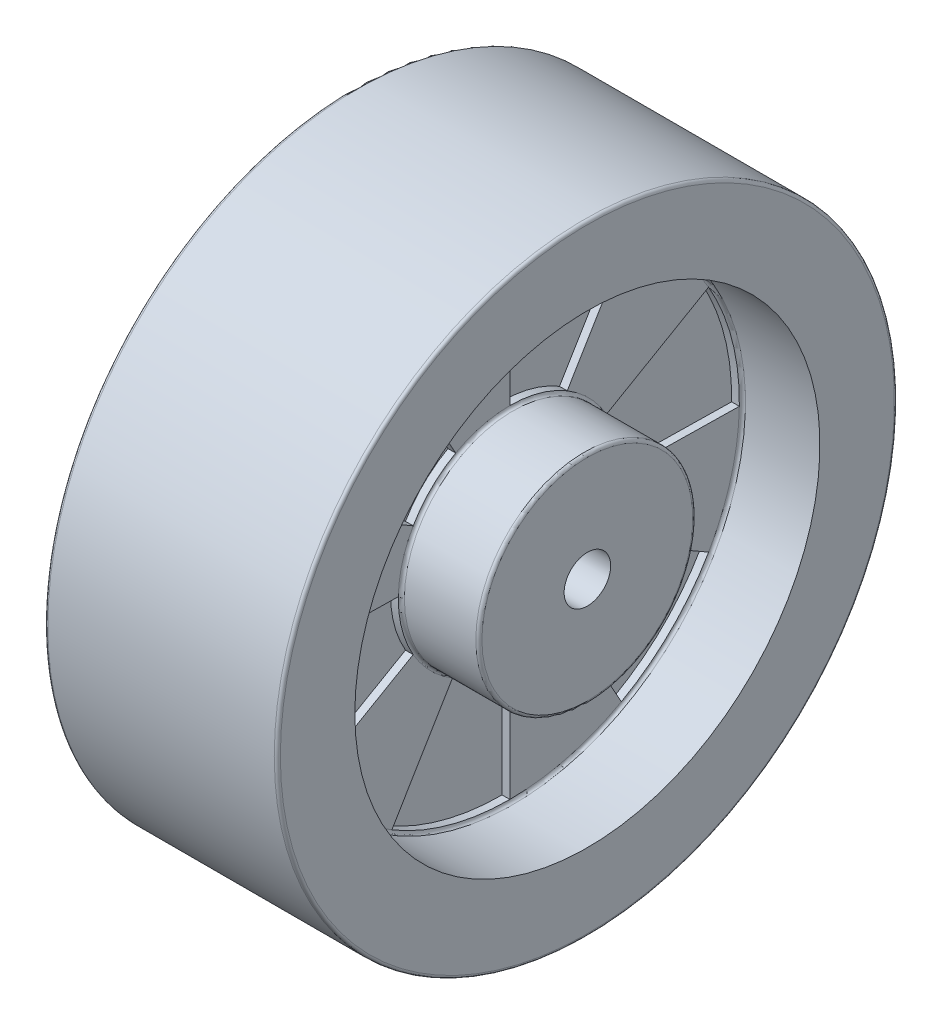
ISO-10303-21;
HEADER;
FILE_DESCRIPTION(('STEP AP214'),'2;1');
FILE_NAME('part.step','',(''),(''),'','','');
FILE_SCHEMA(('AUTOMOTIVE_DESIGN { 1 0 10303 214 1 1 1 1 }'));
ENDSEC;
DATA;
#1=APPLICATION_CONTEXT('core data for automotive mechanical design processes');
#2=APPLICATION_PROTOCOL_DEFINITION('international standard','automotive_design',2000,#1);
#3=PRODUCT_CONTEXT('',#1,'mechanical');
#4=PRODUCT('Part','Part','',(#3));
#5=PRODUCT_RELATED_PRODUCT_CATEGORY('part','',(#4));
#6=PRODUCT_DEFINITION_FORMATION('','',#4);
#7=PRODUCT_DEFINITION_CONTEXT('part definition',#1,'design');
#8=PRODUCT_DEFINITION('design','',#6,#7);
#9=PRODUCT_DEFINITION_SHAPE('','',#8);
#10=(LENGTH_UNIT() NAMED_UNIT(*) SI_UNIT(.MILLI.,.METRE.));
#11=(NAMED_UNIT(*) PLANE_ANGLE_UNIT() SI_UNIT($,.RADIAN.));
#12=(NAMED_UNIT(*) SI_UNIT($,.STERADIAN.) SOLID_ANGLE_UNIT());
#13=UNCERTAINTY_MEASURE_WITH_UNIT(LENGTH_MEASURE(1.E-05),#10,'distance_accuracy_value','');
#14=(GEOMETRIC_REPRESENTATION_CONTEXT(3) GLOBAL_UNCERTAINTY_ASSIGNED_CONTEXT((#13)) GLOBAL_UNIT_ASSIGNED_CONTEXT((#10,
#11,#12)) REPRESENTATION_CONTEXT('',''));
#15=CARTESIAN_POINT('',(0.,0.,0.));
#16=DIRECTION('',(0.,0.,1.));
#17=DIRECTION('',(1.,0.,0.));
#18=AXIS2_PLACEMENT_3D('',#15,#16,#17);
#19=CARTESIAN_POINT('',(-12.7,76.2,0.));
#20=DIRECTION('',(1.,0.,0.));
#21=DIRECTION('',(0.,0.,-1.));
#22=AXIS2_PLACEMENT_3D('',#19,#20,#21);
#23=PLANE('',#22);
#24=DIRECTION('',(0.,-0.874183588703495,-0.485595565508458));
#25=VECTOR('',#24,1.);
#26=CARTESIAN_POINT('',(-12.7,0.,0.));
#27=LINE('',#26,#25);
#28=CARTESIAN_POINT('',(-12.7,-31.9601520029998,-17.7533738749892));
#29=VERTEX_POINT('',#28);
#30=CARTESIAN_POINT('',(-12.7,-65.7386058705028,-36.516786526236));
#31=VERTEX_POINT('',#30);
#32=EDGE_CURVE('E447',#29,#31,#27,.T.);
#33=ORIENTED_EDGE('',*,*,#32,.T.);
#34=CARTESIAN_POINT('',(-12.7,0.,0.));
#35=DIRECTION('',(1.,0.,0.));
#36=DIRECTION('',(0.,0.,-1.));
#37=AXIS2_PLACEMENT_3D('',#34,#35,#36);
#38=CIRCLE('',#37,75.2);
#39=CARTESIAN_POINT('',(-12.7,-75.2,0.));
#40=VERTEX_POINT('',#39);
#41=EDGE_CURVE('E924',#31,#40,#38,.F.);
#42=ORIENTED_EDGE('',*,*,#41,.T.);
#43=DIRECTION('',(0.,-1.,0.));
#44=VECTOR('',#43,1.);
#45=CARTESIAN_POINT('',(-12.7,0.,0.));
#46=LINE('',#45,#44);
#47=CARTESIAN_POINT('',(-12.7,-36.56,0.));
#48=VERTEX_POINT('',#47);
#49=EDGE_CURVE('E417',#48,#40,#46,.T.);
#50=ORIENTED_EDGE('',*,*,#49,.F.);
#51=CARTESIAN_POINT('',(-12.7,0.,0.));
#52=DIRECTION('',(1.,0.,0.));
#53=DIRECTION('',(0.,0.,-1.));
#54=AXIS2_PLACEMENT_3D('',#51,#52,#53);
#55=CIRCLE('',#54,36.56);
#56=EDGE_CURVE('E1058',#48,#29,#55,.T.);
#57=ORIENTED_EDGE('',*,*,#56,.T.);
#58=EDGE_LOOP('',(#33,#42,#50,#57));
#59=FACE_BOUND('',#58,.T.);
#60=ADVANCED_FACE('F39',(#59),#23,.F.);
#61=DIRECTION('',(0.,-0.857629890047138,0.514267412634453));
#62=VECTOR('',#61,1.);
#63=CARTESIAN_POINT('',(-12.7,0.,0.));
#64=LINE('',#63,#62);
#65=CARTESIAN_POINT('',(-12.7,-31.3549487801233,18.8016166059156));
#66=VERTEX_POINT('',#65);
#67=CARTESIAN_POINT('',(-12.7,-64.4937677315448,38.6729094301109));
#68=VERTEX_POINT('',#67);
#69=EDGE_CURVE('E402',#66,#68,#64,.T.);
#70=ORIENTED_EDGE('',*,*,#69,.T.);
#71=CARTESIAN_POINT('',(-12.7,-37.6000000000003,65.1251103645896));
#72=VERTEX_POINT('',#71);
#73=EDGE_CURVE('E1023',#68,#72,#38,.F.);
#74=ORIENTED_EDGE('',*,*,#73,.T.);
#75=DIRECTION('',(0.,-0.500000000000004,0.866025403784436));
#76=VECTOR('',#75,1.);
#77=CARTESIAN_POINT('',(-12.7,0.,0.));
#78=LINE('',#77,#76);
#79=CARTESIAN_POINT('',(-12.7,-18.2800000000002,31.661888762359));
#80=VERTEX_POINT('',#79);
#81=EDGE_CURVE('E547',#80,#72,#78,.T.);
#82=ORIENTED_EDGE('',*,*,#81,.F.);
#83=EDGE_CURVE('E1047',#80,#66,#55,.T.);
#84=ORIENTED_EDGE('',*,*,#83,.T.);
#85=EDGE_LOOP('',(#70,#74,#82,#84));
#86=FACE_BOUND('',#85,.T.);
#87=ADVANCED_FACE('F988',(#86),#23,.F.);
#88=DIRECTION('',(0.,0.0165536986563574,0.999862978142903));
#89=VECTOR('',#88,1.);
#90=CARTESIAN_POINT('',(-12.7,0.,0.));
#91=LINE('',#90,#89);
#92=CARTESIAN_POINT('',(-12.7,0.605203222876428,36.5549904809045));
#93=VERTEX_POINT('',#92);
#94=CARTESIAN_POINT('',(-12.7,1.24483813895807,75.1896959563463));
#95=VERTEX_POINT('',#94);
#96=EDGE_CURVE('E533',#93,#95,#91,.T.);
#97=ORIENTED_EDGE('',*,*,#96,.T.);
#98=CARTESIAN_POINT('',(-12.7,37.5999999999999,65.1251103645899));
#99=VERTEX_POINT('',#98);
#100=EDGE_CURVE('E1018',#95,#99,#38,.F.);
#101=ORIENTED_EDGE('',*,*,#100,.T.);
#102=DIRECTION('',(0.,0.499999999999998,0.86602540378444));
#103=VECTOR('',#102,1.);
#104=CARTESIAN_POINT('',(-12.7,0.,0.));
#105=LINE('',#104,#103);
#106=CARTESIAN_POINT('',(-12.7,18.2799999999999,31.6618887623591));
#107=VERTEX_POINT('',#106);
#108=EDGE_CURVE('E503',#107,#99,#105,.T.);
#109=ORIENTED_EDGE('',*,*,#108,.F.);
#110=EDGE_CURVE('E1064',#107,#93,#55,.T.);
#111=ORIENTED_EDGE('',*,*,#110,.T.);
#112=EDGE_LOOP('',(#97,#101,#109,#111));
#113=FACE_BOUND('',#112,.T.);
#114=ADVANCED_FACE('F994',(#113),#23,.F.);
#115=DIRECTION('',(0.,0.874183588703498,0.485595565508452));
#116=VECTOR('',#115,1.);
#117=CARTESIAN_POINT('',(-12.7,0.,0.));
#118=LINE('',#117,#116);
#119=CARTESIAN_POINT('',(-12.7,31.9601520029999,17.753373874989));
#120=VERTEX_POINT('',#119);
#121=CARTESIAN_POINT('',(-12.7,65.7386058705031,36.5167865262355));
#122=VERTEX_POINT('',#121);
#123=EDGE_CURVE('E488',#120,#122,#118,.T.);
#124=ORIENTED_EDGE('',*,*,#123,.T.);
#125=CARTESIAN_POINT('',(-12.7,75.2,0.));
#126=VERTEX_POINT('',#125);
#127=EDGE_CURVE('E1015',#122,#126,#38,.F.);
#128=ORIENTED_EDGE('',*,*,#127,.T.);
#129=DIRECTION('',(0.,1.,0.));
#130=VECTOR('',#129,1.);
#131=CARTESIAN_POINT('',(-12.7,0.,0.));
#132=LINE('',#131,#130);
#133=CARTESIAN_POINT('',(-12.7,36.56,0.));
#134=VERTEX_POINT('',#133);
#135=EDGE_CURVE('E63',#134,#126,#132,.T.);
#136=ORIENTED_EDGE('',*,*,#135,.F.);
#137=EDGE_CURVE('E930',#134,#120,#55,.T.);
#138=ORIENTED_EDGE('',*,*,#137,.T.);
#139=EDGE_LOOP('',(#124,#128,#136,#138));
#140=FACE_BOUND('',#139,.T.);
#141=ADVANCED_FACE('F1008',(#140),#23,.F.);
#142=CARTESIAN_POINT('',(-12.7,-1.24483813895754,-75.1896959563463));
#143=VERTEX_POINT('',#142);
#144=CARTESIAN_POINT('',(-12.7,-37.5999999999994,-65.1251103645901));
#145=VERTEX_POINT('',#144);
#146=EDGE_CURVE('E919',#143,#145,#38,.F.);
#147=ORIENTED_EDGE('',*,*,#146,.T.);
#148=DIRECTION('',(0.,-0.499999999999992,-0.866025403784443));
#149=VECTOR('',#148,1.);
#150=CARTESIAN_POINT('',(-12.7,0.,0.));
#151=LINE('',#150,#149);
#152=CARTESIAN_POINT('',(-12.7,-18.2799999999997,-31.6618887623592));
#153=VERTEX_POINT('',#152);
#154=EDGE_CURVE('E461',#153,#145,#151,.T.);
#155=ORIENTED_EDGE('',*,*,#154,.F.);
#156=CARTESIAN_POINT('',(-12.7,-0.605203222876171,-36.5549904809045));
#157=VERTEX_POINT('',#156);
#158=EDGE_CURVE('E923',#153,#157,#55,.T.);
#159=ORIENTED_EDGE('',*,*,#158,.T.);
#160=DIRECTION('',(0.,-0.0165536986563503,-0.999862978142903));
#161=VECTOR('',#160,1.);
#162=CARTESIAN_POINT('',(-12.7,0.,0.));
#163=LINE('',#162,#161);
#164=EDGE_CURVE('E366',#157,#143,#163,.T.);
#165=ORIENTED_EDGE('',*,*,#164,.T.);
#166=EDGE_LOOP('',(#147,#155,#159,#165));
#167=FACE_BOUND('',#166,.T.);
#168=ADVANCED_FACE('F998',(#167),#23,.F.);
#169=CARTESIAN_POINT('',(-12.7,64.4937677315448,-38.6729094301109));
#170=VERTEX_POINT('',#169);
#171=CARTESIAN_POINT('',(-12.7,37.6000000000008,-65.1251103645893));
#172=VERTEX_POINT('',#171);
#173=EDGE_CURVE('E918',#170,#172,#38,.F.);
#174=ORIENTED_EDGE('',*,*,#173,.T.);
#175=DIRECTION('',(0.,0.50000000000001,-0.866025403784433));
#176=VECTOR('',#175,1.);
#177=CARTESIAN_POINT('',(-12.7,0.,0.));
#178=LINE('',#177,#176);
#179=CARTESIAN_POINT('',(-12.7,18.2800000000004,-31.6618887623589));
#180=VERTEX_POINT('',#179);
#181=EDGE_CURVE('E55',#180,#172,#178,.T.);
#182=ORIENTED_EDGE('',*,*,#181,.F.);
#183=CARTESIAN_POINT('',(-12.7,31.3549487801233,-18.8016166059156));
#184=VERTEX_POINT('',#183);
#185=EDGE_CURVE('E925',#180,#184,#55,.T.);
#186=ORIENTED_EDGE('',*,*,#185,.T.);
#187=DIRECTION('',(0.,0.857629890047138,-0.514267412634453));
#188=VECTOR('',#187,1.);
#189=CARTESIAN_POINT('',(-12.7,0.,0.));
#190=LINE('',#189,#188);
#191=EDGE_CURVE('E574',#184,#170,#190,.T.);
#192=ORIENTED_EDGE('',*,*,#191,.T.);
#193=EDGE_LOOP('',(#174,#182,#186,#192));
#194=FACE_BOUND('',#193,.T.);
#195=ADVANCED_FACE('F990',(#194),#23,.F.);
#196=CARTESIAN_POINT('',(12.7,35.56,0.));
#197=DIRECTION('',(-1.,0.,0.));
#198=DIRECTION('',(0.,0.,1.));
#199=AXIS2_PLACEMENT_3D('',#196,#197,#198);
#200=PLANE('',#199);
#201=DIRECTION('',(0.,0.50000000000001,-0.866025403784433));
#202=VECTOR('',#201,1.);
#203=CARTESIAN_POINT('',(12.7,0.,0.));
#204=LINE('',#203,#202);
#205=CARTESIAN_POINT('',(12.7,18.2800000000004,-31.6618887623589));
#206=VERTEX_POINT('',#205);
#207=CARTESIAN_POINT('',(12.7,37.6000000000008,-65.1251103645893));
#208=VERTEX_POINT('',#207);
#209=EDGE_CURVE('E749',#206,#208,#204,.T.);
#210=ORIENTED_EDGE('',*,*,#209,.T.);
#211=CARTESIAN_POINT('',(12.7,0.,0.));
#212=DIRECTION('',(-1.,0.,0.));
#213=DIRECTION('',(0.,0.,1.));
#214=AXIS2_PLACEMENT_3D('',#211,#212,#213);
#215=CIRCLE('',#214,75.2);
#216=CARTESIAN_POINT('',(12.7,64.4937677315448,-38.6729094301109));
#217=VERTEX_POINT('',#216);
#218=EDGE_CURVE('E891',#208,#217,#215,.F.);
#219=ORIENTED_EDGE('',*,*,#218,.T.);
#220=DIRECTION('',(0.,0.857629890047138,-0.514267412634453));
#221=VECTOR('',#220,1.);
#222=CARTESIAN_POINT('',(12.7,0.,0.));
#223=LINE('',#222,#221);
#224=CARTESIAN_POINT('',(12.7,31.3549487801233,-18.8016166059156));
#225=VERTEX_POINT('',#224);
#226=EDGE_CURVE('E821',#225,#217,#223,.T.);
#227=ORIENTED_EDGE('',*,*,#226,.F.);
#228=CARTESIAN_POINT('',(12.7,0.,0.));
#229=DIRECTION('',(-1.,0.,0.));
#230=DIRECTION('',(0.,0.,1.));
#231=AXIS2_PLACEMENT_3D('',#228,#229,#230);
#232=CIRCLE('',#231,36.56);
#233=EDGE_CURVE('E892',#225,#206,#232,.T.);
#234=ORIENTED_EDGE('',*,*,#233,.T.);
#235=EDGE_LOOP('',(#210,#219,#227,#234));
#236=FACE_BOUND('',#235,.T.);
#237=ADVANCED_FACE('F997',(#236),#200,.F.);
#238=CARTESIAN_POINT('',(12.7,-37.5999999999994,-65.1251103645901));
#239=VERTEX_POINT('',#238);
#240=CARTESIAN_POINT('',(12.7,-1.24483813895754,-75.1896959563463));
#241=VERTEX_POINT('',#240);
#242=EDGE_CURVE('E1337',#239,#241,#215,.F.);
#243=ORIENTED_EDGE('',*,*,#242,.T.);
#244=DIRECTION('',(0.,-0.0165536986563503,-0.999862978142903));
#245=VECTOR('',#244,1.);
#246=CARTESIAN_POINT('',(12.7,0.,0.));
#247=LINE('',#246,#245);
#248=CARTESIAN_POINT('',(12.7,-0.605203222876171,-36.5549904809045));
#249=VERTEX_POINT('',#248);
#250=EDGE_CURVE('E764',#249,#241,#247,.T.);
#251=ORIENTED_EDGE('',*,*,#250,.F.);
#252=CARTESIAN_POINT('',(12.7,-18.2799999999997,-31.6618887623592));
#253=VERTEX_POINT('',#252);
#254=EDGE_CURVE('E1288',#249,#253,#232,.T.);
#255=ORIENTED_EDGE('',*,*,#254,.T.);
#256=DIRECTION('',(0.,-0.499999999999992,-0.866025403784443));
#257=VECTOR('',#256,1.);
#258=CARTESIAN_POINT('',(12.7,0.,0.));
#259=LINE('',#258,#257);
#260=EDGE_CURVE('E705',#253,#239,#259,.T.);
#261=ORIENTED_EDGE('',*,*,#260,.T.);
#262=EDGE_LOOP('',(#243,#251,#255,#261));
#263=FACE_BOUND('',#262,.T.);
#264=ADVANCED_FACE('F1004',(#263),#200,.F.);
#265=DIRECTION('',(0.,-0.500000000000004,0.866025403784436));
#266=VECTOR('',#265,1.);
#267=CARTESIAN_POINT('',(12.7,0.,0.));
#268=LINE('',#267,#266);
#269=CARTESIAN_POINT('',(12.7,-18.2800000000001,31.661888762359));
#270=VERTEX_POINT('',#269);
#271=CARTESIAN_POINT('',(12.7,-37.6000000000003,65.1251103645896));
#272=VERTEX_POINT('',#271);
#273=EDGE_CURVE('E661',#270,#272,#268,.T.);
#274=ORIENTED_EDGE('',*,*,#273,.T.);
#275=CARTESIAN_POINT('',(12.7,-64.4937677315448,38.6729094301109));
#276=VERTEX_POINT('',#275);
#277=EDGE_CURVE('E1330',#272,#276,#215,.F.);
#278=ORIENTED_EDGE('',*,*,#277,.T.);
#279=DIRECTION('',(0.,-0.857629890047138,0.514267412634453));
#280=VECTOR('',#279,1.);
#281=CARTESIAN_POINT('',(12.7,0.,0.));
#282=LINE('',#281,#280);
#283=CARTESIAN_POINT('',(12.7,-31.3549487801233,18.8016166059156));
#284=VERTEX_POINT('',#283);
#285=EDGE_CURVE('E631',#284,#276,#282,.T.);
#286=ORIENTED_EDGE('',*,*,#285,.F.);
#287=EDGE_CURVE('E1296',#284,#270,#232,.T.);
#288=ORIENTED_EDGE('',*,*,#287,.T.);
#289=EDGE_LOOP('',(#274,#278,#286,#288));
#290=FACE_BOUND('',#289,.T.);
#291=ADVANCED_FACE('F1359',(#290),#200,.F.);
#292=CARTESIAN_POINT('',(12.7,-75.2,0.));
#293=VERTEX_POINT('',#292);
#294=CARTESIAN_POINT('',(12.7,-65.7386058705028,-36.516786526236));
#295=VERTEX_POINT('',#294);
#296=EDGE_CURVE('E1333',#293,#295,#215,.F.);
#297=ORIENTED_EDGE('',*,*,#296,.T.);
#298=DIRECTION('',(0.,-0.874183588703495,-0.485595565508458));
#299=VECTOR('',#298,1.);
#300=CARTESIAN_POINT('',(12.7,0.,0.));
#301=LINE('',#300,#299);
#302=CARTESIAN_POINT('',(12.7,-31.9601520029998,-17.7533738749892));
#303=VERTEX_POINT('',#302);
#304=EDGE_CURVE('E721',#303,#295,#301,.T.);
#305=ORIENTED_EDGE('',*,*,#304,.F.);
#306=CARTESIAN_POINT('',(12.7,-36.56,0.));
#307=VERTEX_POINT('',#306);
#308=EDGE_CURVE('E1291',#303,#307,#232,.T.);
#309=ORIENTED_EDGE('',*,*,#308,.T.);
#310=DIRECTION('',(0.,-1.,0.));
#311=VECTOR('',#310,1.);
#312=CARTESIAN_POINT('',(12.7,0.,0.));
#313=LINE('',#312,#311);
#314=EDGE_CURVE('E615',#307,#293,#313,.T.);
#315=ORIENTED_EDGE('',*,*,#314,.T.);
#316=EDGE_LOOP('',(#297,#305,#309,#315));
#317=FACE_BOUND('',#316,.T.);
#318=ADVANCED_FACE('F1353',(#317),#200,.F.);
#319=CARTESIAN_POINT('',(12.7,37.5999999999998,65.1251103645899));
#320=VERTEX_POINT('',#319);
#321=CARTESIAN_POINT('',(12.7,1.24483813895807,75.1896959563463));
#322=VERTEX_POINT('',#321);
#323=EDGE_CURVE('E1327',#320,#322,#215,.F.);
#324=ORIENTED_EDGE('',*,*,#323,.T.);
#325=DIRECTION('',(0.,0.0165536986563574,0.999862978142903));
#326=VECTOR('',#325,1.);
#327=CARTESIAN_POINT('',(12.7,0.,0.));
#328=LINE('',#327,#326);
#329=CARTESIAN_POINT('',(12.7,0.605203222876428,36.5549904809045));
#330=VERTEX_POINT('',#329);
#331=EDGE_CURVE('E676',#330,#322,#328,.T.);
#332=ORIENTED_EDGE('',*,*,#331,.F.);
#333=CARTESIAN_POINT('',(12.7,18.2799999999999,31.6618887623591));
#334=VERTEX_POINT('',#333);
#335=EDGE_CURVE('E1302',#330,#334,#232,.T.);
#336=ORIENTED_EDGE('',*,*,#335,.T.);
#337=DIRECTION('',(0.,0.499999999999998,0.86602540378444));
#338=VECTOR('',#337,1.);
#339=CARTESIAN_POINT('',(12.7,0.,0.));
#340=LINE('',#339,#338);
#341=EDGE_CURVE('E791',#334,#320,#340,.T.);
#342=ORIENTED_EDGE('',*,*,#341,.T.);
#343=EDGE_LOOP('',(#324,#332,#336,#342));
#344=FACE_BOUND('',#343,.T.);
#345=ADVANCED_FACE('F1373',(#344),#200,.F.);
#346=CARTESIAN_POINT('',(12.7,75.2,0.));
#347=VERTEX_POINT('',#346);
#348=CARTESIAN_POINT('',(12.7,65.7386058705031,36.5167865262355));
#349=VERTEX_POINT('',#348);
#350=EDGE_CURVE('E898',#347,#349,#215,.F.);
#351=ORIENTED_EDGE('',*,*,#350,.T.);
#352=DIRECTION('',(0.,0.874183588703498,0.485595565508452));
#353=VECTOR('',#352,1.);
#354=CARTESIAN_POINT('',(12.7,0.,0.));
#355=LINE('',#354,#353);
#356=CARTESIAN_POINT('',(12.7,31.9601520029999,17.753373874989));
#357=VERTEX_POINT('',#356);
#358=EDGE_CURVE('E806',#357,#349,#355,.T.);
#359=ORIENTED_EDGE('',*,*,#358,.F.);
#360=CARTESIAN_POINT('',(12.7,36.56,0.));
#361=VERTEX_POINT('',#360);
#362=EDGE_CURVE('E886',#357,#361,#232,.T.);
#363=ORIENTED_EDGE('',*,*,#362,.T.);
#364=DIRECTION('',(0.,1.,0.));
#365=VECTOR('',#364,1.);
#366=CARTESIAN_POINT('',(12.7,0.,0.));
#367=LINE('',#366,#365);
#368=EDGE_CURVE('E835',#361,#347,#367,.T.);
#369=ORIENTED_EDGE('',*,*,#368,.T.);
#370=EDGE_LOOP('',(#351,#359,#363,#369));
#371=FACE_BOUND('',#370,.T.);
#372=ADVANCED_FACE('F1007',(#371),#200,.F.);
#373=CARTESIAN_POINT('',(-38.1,35.56,0.));
#374=DIRECTION('',(1.,0.,0.));
#375=DIRECTION('',(0.,0.,-1.));
#376=AXIS2_PLACEMENT_3D('',#373,#374,#375);
#377=PLANE('',#376);
#378=CARTESIAN_POINT('',(-38.1,0.,0.));
#379=DIRECTION('',(1.,0.,0.));
#380=DIRECTION('',(0.,0.,-1.));
#381=AXIS2_PLACEMENT_3D('',#378,#379,#380);
#382=CIRCLE('',#381,34.56);
#383=CARTESIAN_POINT('',(-38.1,0.,-34.56));
#384=VERTEX_POINT('',#383);
#385=EDGE_CURVE('E929',#384,#384,#382,.F.);
#386=ORIENTED_EDGE('',*,*,#385,.T.);
#387=EDGE_LOOP('',(#386));
#388=FACE_BOUND('',#387,.T.);
#389=CARTESIAN_POINT('',(-38.1,0.,0.));
#390=DIRECTION('',(-1.,0.,0.));
#391=DIRECTION('',(0.,0.,1.));
#392=AXIS2_PLACEMENT_3D('',#389,#390,#391);
#393=CIRCLE('',#392,7.62);
#394=CARTESIAN_POINT('',(-38.1,0.,7.62));
#395=VERTEX_POINT('',#394);
#396=EDGE_CURVE('E878',#395,#395,#393,.T.);
#397=ORIENTED_EDGE('',*,*,#396,.F.);
#398=EDGE_LOOP('',(#397));
#399=FACE_BOUND('',#398,.T.);
#400=ADVANCED_FACE('F1379',(#388,#399),#377,.F.);
#401=CARTESIAN_POINT('',(0.,0.,0.));
#402=DIRECTION('',(-1.,0.,0.));
#403=DIRECTION('',(0.,0.,1.));
#404=AXIS2_PLACEMENT_3D('',#401,#402,#403);
#405=CYLINDRICAL_SURFACE('',#404,7.62);
#406=CARTESIAN_POINT('',(38.1,0.,0.));
#407=DIRECTION('',(-1.,0.,0.));
#408=DIRECTION('',(0.,0.,1.));
#409=AXIS2_PLACEMENT_3D('',#406,#407,#408);
#410=CIRCLE('',#409,7.62);
#411=CARTESIAN_POINT('',(38.1,0.,7.62));
#412=VERTEX_POINT('',#411);
#413=EDGE_CURVE('E874',#412,#412,#410,.T.);
#414=ORIENTED_EDGE('',*,*,#413,.F.);
#415=EDGE_LOOP('',(#414));
#416=FACE_BOUND('',#415,.T.);
#417=ORIENTED_EDGE('',*,*,#396,.T.);
#418=EDGE_LOOP('',(#417));
#419=FACE_BOUND('',#418,.T.);
#420=ADVANCED_FACE('F1391',(#416,#419),#405,.F.);
#421=CARTESIAN_POINT('',(38.1,7.62,0.));
#422=DIRECTION('',(-1.,0.,0.));
#423=DIRECTION('',(0.,0.,1.));
#424=AXIS2_PLACEMENT_3D('',#421,#422,#423);
#425=PLANE('',#424);
#426=CARTESIAN_POINT('',(38.1,0.,0.));
#427=DIRECTION('',(-1.,0.,0.));
#428=DIRECTION('',(0.,0.,1.));
#429=AXIS2_PLACEMENT_3D('',#426,#427,#428);
#430=CIRCLE('',#429,34.56);
#431=CARTESIAN_POINT('',(38.1,0.,34.56));
#432=VERTEX_POINT('',#431);
#433=EDGE_CURVE('E906',#432,#432,#430,.F.);
#434=ORIENTED_EDGE('',*,*,#433,.T.);
#435=EDGE_LOOP('',(#434));
#436=FACE_BOUND('',#435,.T.);
#437=ORIENTED_EDGE('',*,*,#413,.T.);
#438=EDGE_LOOP('',(#437));
#439=FACE_BOUND('',#438,.T.);
#440=ADVANCED_FACE('F1387',(#436,#439),#425,.F.);
#441=CARTESIAN_POINT('',(0.,0.,0.));
#442=DIRECTION('',(-1.,0.,0.));
#443=DIRECTION('',(0.,0.,1.));
#444=AXIS2_PLACEMENT_3D('',#441,#442,#443);
#445=CYLINDRICAL_SURFACE('',#444,35.56);
#446=CARTESIAN_POINT('',(13.7,0.,0.));
#447=DIRECTION('',(-1.,0.,0.));
#448=DIRECTION('',(0.,0.,1.));
#449=AXIS2_PLACEMENT_3D('',#446,#447,#448);
#450=CIRCLE('',#449,35.56);
#451=CARTESIAN_POINT('',(13.7,0.,35.56));
#452=VERTEX_POINT('',#451);
#453=EDGE_CURVE('E902',#452,#452,#450,.F.);
#454=ORIENTED_EDGE('',*,*,#453,.T.);
#455=EDGE_LOOP('',(#454));
#456=FACE_BOUND('',#455,.T.);
#457=CARTESIAN_POINT('',(37.1,0.,0.));
#458=DIRECTION('',(-1.,0.,0.));
#459=DIRECTION('',(0.,0.,1.));
#460=AXIS2_PLACEMENT_3D('',#457,#458,#459);
#461=CIRCLE('',#460,35.56);
#462=CARTESIAN_POINT('',(37.1,0.,35.56));
#463=VERTEX_POINT('',#462);
#464=EDGE_CURVE('E897',#463,#463,#461,.T.);
#465=ORIENTED_EDGE('',*,*,#464,.T.);
#466=EDGE_LOOP('',(#465));
#467=FACE_BOUND('',#466,.T.);
#468=ADVANCED_FACE('F1384',(#456,#467),#445,.T.);
#469=CARTESIAN_POINT('',(0.,0.,0.));
#470=DIRECTION('',(-1.,0.,0.));
#471=DIRECTION('',(0.,0.,1.));
#472=AXIS2_PLACEMENT_3D('',#469,#470,#471);
#473=CYLINDRICAL_SURFACE('',#472,76.2);
#474=CARTESIAN_POINT('',(13.7,0.,0.));
#475=DIRECTION('',(-1.,0.,0.));
#476=DIRECTION('',(0.,0.,1.));
#477=AXIS2_PLACEMENT_3D('',#474,#475,#476);
#478=CIRCLE('',#477,76.2);
#479=CARTESIAN_POINT('',(13.7,0.,76.2));
#480=VERTEX_POINT('',#479);
#481=EDGE_CURVE('E882',#480,#480,#478,.T.);
#482=ORIENTED_EDGE('',*,*,#481,.T.);
#483=EDGE_LOOP('',(#482));
#484=FACE_BOUND('',#483,.T.);
#485=CARTESIAN_POINT('',(38.1,0.,0.));
#486=DIRECTION('',(-1.,0.,0.));
#487=DIRECTION('',(0.,0.,1.));
#488=AXIS2_PLACEMENT_3D('',#485,#486,#487);
#489=CIRCLE('',#488,76.2);
#490=CARTESIAN_POINT('',(38.1,0.,76.2));
#491=VERTEX_POINT('',#490);
#492=EDGE_CURVE('E870',#491,#491,#489,.T.);
#493=ORIENTED_EDGE('',*,*,#492,.F.);
#494=EDGE_LOOP('',(#493));
#495=FACE_BOUND('',#494,.T.);
#496=ADVANCED_FACE('F1382',(#484,#495),#473,.F.);
#497=CARTESIAN_POINT('',(38.1,76.2,0.));
#498=DIRECTION('',(-1.,0.,0.));
#499=DIRECTION('',(0.,0.,1.));
#500=AXIS2_PLACEMENT_3D('',#497,#498,#499);
#501=PLANE('',#500);
#502=CARTESIAN_POINT('',(38.1,0.,0.));
#503=DIRECTION('',(-1.,0.,0.));
#504=DIRECTION('',(0.,0.,1.));
#505=AXIS2_PLACEMENT_3D('',#502,#503,#504);
#506=CIRCLE('',#505,100.6);
#507=CARTESIAN_POINT('',(38.1,0.,100.6));
#508=VERTEX_POINT('',#507);
#509=EDGE_CURVE('E48',#508,#508,#506,.F.);
#510=ORIENTED_EDGE('',*,*,#509,.T.);
#511=EDGE_LOOP('',(#510));
#512=FACE_BOUND('',#511,.T.);
#513=ORIENTED_EDGE('',*,*,#492,.T.);
#514=EDGE_LOOP('',(#513));
#515=FACE_BOUND('',#514,.T.);
#516=ADVANCED_FACE('F949',(#512,#515),#501,.F.);
#517=CARTESIAN_POINT('',(0.,0.,0.));
#518=DIRECTION('',(-1.,0.,0.));
#519=DIRECTION('',(0.,0.,1.));
#520=AXIS2_PLACEMENT_3D('',#517,#518,#519);
#521=CYLINDRICAL_SURFACE('',#520,101.6);
#522=CARTESIAN_POINT('',(37.1,0.,0.));
#523=DIRECTION('',(-1.,0.,0.));
#524=DIRECTION('',(0.,0.,1.));
#525=AXIS2_PLACEMENT_3D('',#522,#523,#524);
#526=CIRCLE('',#525,101.6);
#527=CARTESIAN_POINT('',(37.1,0.,101.6));
#528=VERTEX_POINT('',#527);
#529=EDGE_CURVE('E942',#528,#528,#526,.T.);
#530=ORIENTED_EDGE('',*,*,#529,.T.);
#531=EDGE_LOOP('',(#530));
#532=FACE_BOUND('',#531,.T.);
#533=CARTESIAN_POINT('',(-37.1,0.,0.));
#534=DIRECTION('',(1.,0.,0.));
#535=DIRECTION('',(0.,0.,-1.));
#536=AXIS2_PLACEMENT_3D('',#533,#534,#535);
#537=CIRCLE('',#536,101.6);
#538=CARTESIAN_POINT('',(-37.1,0.,-101.6));
#539=VERTEX_POINT('',#538);
#540=EDGE_CURVE('E938',#539,#539,#537,.T.);
#541=ORIENTED_EDGE('',*,*,#540,.T.);
#542=EDGE_LOOP('',(#541));
#543=FACE_BOUND('',#542,.T.);
#544=ADVANCED_FACE('F958',(#532,#543),#521,.T.);
#545=CARTESIAN_POINT('',(-38.1,101.6,0.));
#546=DIRECTION('',(1.,0.,0.));
#547=DIRECTION('',(0.,0.,-1.));
#548=AXIS2_PLACEMENT_3D('',#545,#546,#547);
#549=PLANE('',#548);
#550=CARTESIAN_POINT('',(-38.1,0.,0.));
#551=DIRECTION('',(1.,0.,0.));
#552=DIRECTION('',(0.,0.,-1.));
#553=AXIS2_PLACEMENT_3D('',#550,#551,#552);
#554=CIRCLE('',#553,100.6);
#555=CARTESIAN_POINT('',(-38.1,0.,-100.6));
#556=VERTEX_POINT('',#555);
#557=EDGE_CURVE('E11',#556,#556,#554,.F.);
#558=ORIENTED_EDGE('',*,*,#557,.T.);
#559=EDGE_LOOP('',(#558));
#560=FACE_BOUND('',#559,.T.);
#561=CARTESIAN_POINT('',(-38.1,0.,0.));
#562=DIRECTION('',(-1.,0.,0.));
#563=DIRECTION('',(0.,0.,1.));
#564=AXIS2_PLACEMENT_3D('',#561,#562,#563);
#565=CIRCLE('',#564,76.2);
#566=CARTESIAN_POINT('',(-38.1,0.,76.2));
#567=VERTEX_POINT('',#566);
#568=EDGE_CURVE('E857',#567,#567,#565,.T.);
#569=ORIENTED_EDGE('',*,*,#568,.F.);
#570=EDGE_LOOP('',(#569));
#571=FACE_BOUND('',#570,.T.);
#572=ADVANCED_FACE('F961',(#560,#571),#549,.F.);
#573=CARTESIAN_POINT('',(0.,0.,0.));
#574=DIRECTION('',(-1.,0.,0.));
#575=DIRECTION('',(0.,0.,1.));
#576=AXIS2_PLACEMENT_3D('',#573,#574,#575);
#577=CYLINDRICAL_SURFACE('',#576,76.2);
#578=CARTESIAN_POINT('',(-13.7,0.,0.));
#579=DIRECTION('',(1.,0.,0.));
#580=DIRECTION('',(0.,0.,-1.));
#581=AXIS2_PLACEMENT_3D('',#578,#579,#580);
#582=CIRCLE('',#581,76.2);
#583=CARTESIAN_POINT('',(-13.7,0.,-76.2));
#584=VERTEX_POINT('',#583);
#585=EDGE_CURVE('E934',#584,#584,#582,.T.);
#586=ORIENTED_EDGE('',*,*,#585,.T.);
#587=EDGE_LOOP('',(#586));
#588=FACE_BOUND('',#587,.T.);
#589=ORIENTED_EDGE('',*,*,#568,.T.);
#590=EDGE_LOOP('',(#589));
#591=FACE_BOUND('',#590,.T.);
#592=ADVANCED_FACE('F972',(#588,#591),#577,.F.);
#593=CARTESIAN_POINT('',(0.,0.,0.));
#594=DIRECTION('',(-1.,0.,0.));
#595=DIRECTION('',(0.,0.,1.));
#596=AXIS2_PLACEMENT_3D('',#593,#594,#595);
#597=CYLINDRICAL_SURFACE('',#596,35.56);
#598=CARTESIAN_POINT('',(-13.7,0.,0.));
#599=DIRECTION('',(1.,0.,0.));
#600=DIRECTION('',(0.,0.,-1.));
#601=AXIS2_PLACEMENT_3D('',#598,#599,#600);
#602=CIRCLE('',#601,35.56);
#603=CARTESIAN_POINT('',(-13.7,0.,-35.56));
#604=VERTEX_POINT('',#603);
#605=EDGE_CURVE('E914',#604,#604,#602,.F.);
#606=ORIENTED_EDGE('',*,*,#605,.T.);
#607=EDGE_LOOP('',(#606));
#608=FACE_BOUND('',#607,.T.);
#609=CARTESIAN_POINT('',(-37.1,0.,0.));
#610=DIRECTION('',(1.,0.,0.));
#611=DIRECTION('',(0.,0.,-1.));
#612=AXIS2_PLACEMENT_3D('',#609,#610,#611);
#613=CIRCLE('',#612,35.56);
#614=CARTESIAN_POINT('',(-37.1,0.,-35.56));
#615=VERTEX_POINT('',#614);
#616=EDGE_CURVE('E910',#615,#615,#613,.T.);
#617=ORIENTED_EDGE('',*,*,#616,.T.);
#618=EDGE_LOOP('',(#617));
#619=FACE_BOUND('',#618,.T.);
#620=ADVANCED_FACE('F977',(#608,#619),#597,.T.);
#621=CARTESIAN_POINT('',(13.7,0.,0.));
#622=DIRECTION('',(-1.,0.,0.));
#623=DIRECTION('',(0.,0.,1.));
#624=AXIS2_PLACEMENT_3D('',#621,#622,#623);
#625=TOROIDAL_SURFACE('',#624,75.2,1.);
#626=EDGE_CURVE('E893',#217,#347,#215,.F.);
#627=ORIENTED_EDGE('',*,*,#626,.F.);
#628=ORIENTED_EDGE('',*,*,#218,.F.);
#629=CARTESIAN_POINT('',(12.7,0.,0.));
#630=DIRECTION('',(1.,0.,0.));
#631=DIRECTION('',(0.,-0.866025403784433,-0.50000000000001));
#632=AXIS2_PLACEMENT_3D('',#629,#630,#631);
#633=CIRCLE('',#632,75.2);
#634=EDGE_CURVE('E768',#241,#208,#633,.T.);
#635=ORIENTED_EDGE('',*,*,#634,.F.);
#636=ORIENTED_EDGE('',*,*,#242,.F.);
#637=CARTESIAN_POINT('',(12.7,0.,0.));
#638=DIRECTION('',(1.,0.,0.));
#639=DIRECTION('',(0.,-0.866025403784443,0.499999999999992));
#640=AXIS2_PLACEMENT_3D('',#637,#638,#639);
#641=CIRCLE('',#640,75.2);
#642=EDGE_CURVE('E726',#295,#239,#641,.T.);
#643=ORIENTED_EDGE('',*,*,#642,.F.);
#644=ORIENTED_EDGE('',*,*,#296,.F.);
#645=CARTESIAN_POINT('',(12.7,0.,0.));
#646=DIRECTION('',(1.,0.,0.));
#647=DIRECTION('',(0.,0.,1.));
#648=AXIS2_PLACEMENT_3D('',#645,#646,#647);
#649=CIRCLE('',#648,75.2);
#650=EDGE_CURVE('E636',#276,#293,#649,.T.);
#651=ORIENTED_EDGE('',*,*,#650,.F.);
#652=ORIENTED_EDGE('',*,*,#277,.F.);
#653=CARTESIAN_POINT('',(12.7,0.,0.));
#654=DIRECTION('',(1.,0.,0.));
#655=DIRECTION('',(0.,0.866025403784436,0.500000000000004));
#656=AXIS2_PLACEMENT_3D('',#653,#654,#655);
#657=CIRCLE('',#656,75.2);
#658=EDGE_CURVE('E680',#322,#272,#657,.T.);
#659=ORIENTED_EDGE('',*,*,#658,.F.);
#660=ORIENTED_EDGE('',*,*,#323,.F.);
#661=CARTESIAN_POINT('',(12.7,0.,0.));
#662=DIRECTION('',(1.,0.,0.));
#663=DIRECTION('',(0.,0.86602540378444,-0.499999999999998));
#664=AXIS2_PLACEMENT_3D('',#661,#662,#663);
#665=CIRCLE('',#664,75.2);
#666=EDGE_CURVE('E810',#349,#320,#665,.T.);
#667=ORIENTED_EDGE('',*,*,#666,.F.);
#668=ORIENTED_EDGE('',*,*,#350,.F.);
#669=EDGE_LOOP('',(#627,#628,#635,#636,#643,#644,#651,#652,#659,#660,#667,#668));
#670=FACE_BOUND('',#669,.T.);
#671=ORIENTED_EDGE('',*,*,#481,.F.);
#672=EDGE_LOOP('',(#671));
#673=FACE_BOUND('',#672,.T.);
#674=ADVANCED_FACE('F983',(#670,#673),#625,.F.);
#675=CARTESIAN_POINT('',(13.7,0.,0.));
#676=DIRECTION('',(-1.,0.,0.));
#677=DIRECTION('',(0.,0.,1.));
#678=AXIS2_PLACEMENT_3D('',#675,#676,#677);
#679=TOROIDAL_SURFACE('',#678,36.56,1.);
#680=ORIENTED_EDGE('',*,*,#453,.F.);
#681=EDGE_LOOP('',(#680));
#682=FACE_BOUND('',#681,.T.);
#683=EDGE_CURVE('E887',#361,#225,#232,.T.);
#684=ORIENTED_EDGE('',*,*,#683,.F.);
#685=ORIENTED_EDGE('',*,*,#362,.F.);
#686=CARTESIAN_POINT('',(12.7,0.,0.));
#687=DIRECTION('',(1.,0.,0.));
#688=DIRECTION('',(0.,0.86602540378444,-0.499999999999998));
#689=AXIS2_PLACEMENT_3D('',#686,#687,#688);
#690=CIRCLE('',#689,36.56);
#691=EDGE_CURVE('E691',#334,#357,#690,.F.);
#692=ORIENTED_EDGE('',*,*,#691,.F.);
#693=ORIENTED_EDGE('',*,*,#335,.F.);
#694=CARTESIAN_POINT('',(12.7,0.,0.));
#695=DIRECTION('',(1.,0.,0.));
#696=DIRECTION('',(0.,0.866025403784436,0.500000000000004));
#697=AXIS2_PLACEMENT_3D('',#694,#695,#696);
#698=CIRCLE('',#697,36.56);
#699=EDGE_CURVE('E647',#270,#330,#698,.F.);
#700=ORIENTED_EDGE('',*,*,#699,.F.);
#701=ORIENTED_EDGE('',*,*,#287,.F.);
#702=CARTESIAN_POINT('',(12.7,0.,0.));
#703=DIRECTION('',(1.,0.,0.));
#704=DIRECTION('',(0.,0.,1.));
#705=AXIS2_PLACEMENT_3D('',#702,#703,#704);
#706=CIRCLE('',#705,36.56);
#707=EDGE_CURVE('E627',#307,#284,#706,.F.);
#708=ORIENTED_EDGE('',*,*,#707,.F.);
#709=ORIENTED_EDGE('',*,*,#308,.F.);
#710=CARTESIAN_POINT('',(12.7,0.,0.));
#711=DIRECTION('',(1.,0.,0.));
#712=DIRECTION('',(0.,-0.866025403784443,0.499999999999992));
#713=AXIS2_PLACEMENT_3D('',#710,#711,#712);
#714=CIRCLE('',#713,36.56);
#715=EDGE_CURVE('E717',#253,#303,#714,.F.);
#716=ORIENTED_EDGE('',*,*,#715,.F.);
#717=ORIENTED_EDGE('',*,*,#254,.F.);
#718=CARTESIAN_POINT('',(12.7,0.,0.));
#719=DIRECTION('',(1.,0.,0.));
#720=DIRECTION('',(0.,-0.866025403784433,-0.50000000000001));
#721=AXIS2_PLACEMENT_3D('',#718,#719,#720);
#722=CIRCLE('',#721,36.56);
#723=EDGE_CURVE('E601',#206,#249,#722,.F.);
#724=ORIENTED_EDGE('',*,*,#723,.F.);
#725=ORIENTED_EDGE('',*,*,#233,.F.);
#726=EDGE_LOOP('',(#684,#685,#692,#693,#700,#701,#708,#709,#716,#717,#724,#725));
#727=FACE_BOUND('',#726,.T.);
#728=ADVANCED_FACE('F1285',(#682,#727),#679,.F.);
#729=CARTESIAN_POINT('',(37.1,0.,0.));
#730=DIRECTION('',(-1.,0.,0.));
#731=DIRECTION('',(0.,0.,1.));
#732=AXIS2_PLACEMENT_3D('',#729,#730,#731);
#733=TOROIDAL_SURFACE('',#732,34.56,1.);
#734=ORIENTED_EDGE('',*,*,#433,.F.);
#735=EDGE_LOOP('',(#734));
#736=FACE_BOUND('',#735,.T.);
#737=ORIENTED_EDGE('',*,*,#464,.F.);
#738=EDGE_LOOP('',(#737));
#739=FACE_BOUND('',#738,.T.);
#740=ADVANCED_FACE('F1403',(#736,#739),#733,.T.);
#741=CARTESIAN_POINT('',(-13.7,0.,0.));
#742=DIRECTION('',(1.,0.,0.));
#743=DIRECTION('',(0.,0.,-1.));
#744=AXIS2_PLACEMENT_3D('',#741,#742,#743);
#745=TOROIDAL_SURFACE('',#744,36.56,1.);
#746=ORIENTED_EDGE('',*,*,#185,.F.);
#747=CARTESIAN_POINT('',(-12.7,0.,0.));
#748=DIRECTION('',(1.,0.,0.));
#749=DIRECTION('',(0.,-0.866025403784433,-0.50000000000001));
#750=AXIS2_PLACEMENT_3D('',#747,#748,#749);
#751=CIRCLE('',#750,36.56);
#752=EDGE_CURVE('E354',#180,#157,#751,.F.);
#753=ORIENTED_EDGE('',*,*,#752,.T.);
#754=ORIENTED_EDGE('',*,*,#158,.F.);
#755=CARTESIAN_POINT('',(-12.7,0.,0.));
#756=DIRECTION('',(1.,0.,0.));
#757=DIRECTION('',(0.,-0.866025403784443,0.499999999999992));
#758=AXIS2_PLACEMENT_3D('',#755,#756,#757);
#759=CIRCLE('',#758,36.56);
#760=EDGE_CURVE('E391',#153,#29,#759,.F.);
#761=ORIENTED_EDGE('',*,*,#760,.T.);
#762=ORIENTED_EDGE('',*,*,#56,.F.);
#763=CARTESIAN_POINT('',(-12.7,0.,0.));
#764=DIRECTION('',(1.,0.,0.));
#765=DIRECTION('',(0.,0.,1.));
#766=AXIS2_PLACEMENT_3D('',#763,#764,#765);
#767=CIRCLE('',#766,36.56);
#768=EDGE_CURVE('E413',#48,#66,#767,.F.);
#769=ORIENTED_EDGE('',*,*,#768,.T.);
#770=ORIENTED_EDGE('',*,*,#83,.F.);
#771=CARTESIAN_POINT('',(-12.7,0.,0.));
#772=DIRECTION('',(1.,0.,0.));
#773=DIRECTION('',(0.,0.866025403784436,0.500000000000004));
#774=AXIS2_PLACEMENT_3D('',#771,#772,#773);
#775=CIRCLE('',#774,36.56);
#776=EDGE_CURVE('E432',#80,#93,#775,.F.);
#777=ORIENTED_EDGE('',*,*,#776,.T.);
#778=ORIENTED_EDGE('',*,*,#110,.F.);
#779=CARTESIAN_POINT('',(-12.7,0.,0.));
#780=DIRECTION('',(1.,0.,0.));
#781=DIRECTION('',(0.,0.86602540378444,-0.499999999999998));
#782=AXIS2_PLACEMENT_3D('',#779,#780,#781);
#783=CIRCLE('',#782,36.56);
#784=EDGE_CURVE('E499',#107,#120,#783,.F.);
#785=ORIENTED_EDGE('',*,*,#784,.T.);
#786=ORIENTED_EDGE('',*,*,#137,.F.);
#787=CARTESIAN_POINT('',(-12.7,0.,0.));
#788=DIRECTION('',(1.,0.,0.));
#789=DIRECTION('',(0.,0.,-1.));
#790=AXIS2_PLACEMENT_3D('',#787,#788,#789);
#791=CIRCLE('',#790,36.56);
#792=EDGE_CURVE('E518',#134,#184,#791,.F.);
#793=ORIENTED_EDGE('',*,*,#792,.T.);
#794=EDGE_LOOP('',(#746,#753,#754,#761,#762,#769,#770,#777,#778,#785,#786,#793));
#795=FACE_BOUND('',#794,.T.);
#796=ORIENTED_EDGE('',*,*,#605,.F.);
#797=EDGE_LOOP('',(#796));
#798=FACE_BOUND('',#797,.T.);
#799=ADVANCED_FACE('F1056',(#795,#798),#745,.F.);
#800=CARTESIAN_POINT('',(-37.1,0.,0.));
#801=DIRECTION('',(1.,0.,0.));
#802=DIRECTION('',(0.,0.,-1.));
#803=AXIS2_PLACEMENT_3D('',#800,#801,#802);
#804=TOROIDAL_SURFACE('',#803,34.56,1.);
#805=ORIENTED_EDGE('',*,*,#616,.F.);
#806=EDGE_LOOP('',(#805));
#807=FACE_BOUND('',#806,.T.);
#808=ORIENTED_EDGE('',*,*,#385,.F.);
#809=EDGE_LOOP('',(#808));
#810=FACE_BOUND('',#809,.T.);
#811=ADVANCED_FACE('F1410',(#807,#810),#804,.T.);
#812=CARTESIAN_POINT('',(-13.7,0.,0.));
#813=DIRECTION('',(1.,0.,0.));
#814=DIRECTION('',(0.,0.,-1.));
#815=AXIS2_PLACEMENT_3D('',#812,#813,#814);
#816=TOROIDAL_SURFACE('',#815,75.2,1.);
#817=ORIENTED_EDGE('',*,*,#585,.F.);
#818=EDGE_LOOP('',(#817));
#819=FACE_BOUND('',#818,.T.);
#820=ORIENTED_EDGE('',*,*,#146,.F.);
#821=CARTESIAN_POINT('',(-12.7,0.,0.));
#822=DIRECTION('',(1.,0.,0.));
#823=DIRECTION('',(0.,-0.866025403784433,-0.50000000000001));
#824=AXIS2_PLACEMENT_3D('',#821,#822,#823);
#825=CIRCLE('',#824,75.2);
#826=EDGE_CURVE('E381',#143,#172,#825,.T.);
#827=ORIENTED_EDGE('',*,*,#826,.T.);
#828=ORIENTED_EDGE('',*,*,#173,.F.);
#829=CARTESIAN_POINT('',(-12.7,0.,0.));
#830=DIRECTION('',(1.,0.,0.));
#831=DIRECTION('',(0.,0.,-1.));
#832=AXIS2_PLACEMENT_3D('',#829,#830,#831);
#833=CIRCLE('',#832,75.2);
#834=EDGE_CURVE('E590',#170,#126,#833,.T.);
#835=ORIENTED_EDGE('',*,*,#834,.T.);
#836=ORIENTED_EDGE('',*,*,#127,.F.);
#837=CARTESIAN_POINT('',(-12.7,0.,0.));
#838=DIRECTION('',(1.,0.,0.));
#839=DIRECTION('',(0.,0.86602540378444,-0.499999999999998));
#840=AXIS2_PLACEMENT_3D('',#837,#838,#839);
#841=CIRCLE('',#840,75.2);
#842=EDGE_CURVE('E507',#122,#99,#841,.T.);
#843=ORIENTED_EDGE('',*,*,#842,.T.);
#844=ORIENTED_EDGE('',*,*,#100,.F.);
#845=CARTESIAN_POINT('',(-12.7,0.,0.));
#846=DIRECTION('',(1.,0.,0.));
#847=DIRECTION('',(0.,0.866025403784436,0.500000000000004));
#848=AXIS2_PLACEMENT_3D('',#845,#846,#847);
#849=CIRCLE('',#848,75.2);
#850=EDGE_CURVE('E550',#95,#72,#849,.T.);
#851=ORIENTED_EDGE('',*,*,#850,.T.);
#852=ORIENTED_EDGE('',*,*,#73,.F.);
#853=CARTESIAN_POINT('',(-12.7,0.,0.));
#854=DIRECTION('',(1.,0.,0.));
#855=DIRECTION('',(0.,0.,1.));
#856=AXIS2_PLACEMENT_3D('',#853,#854,#855);
#857=CIRCLE('',#856,75.2);
#858=EDGE_CURVE('E421',#68,#40,#857,.T.);
#859=ORIENTED_EDGE('',*,*,#858,.T.);
#860=ORIENTED_EDGE('',*,*,#41,.F.);
#861=CARTESIAN_POINT('',(-12.7,0.,0.));
#862=DIRECTION('',(1.,0.,0.));
#863=DIRECTION('',(0.,-0.866025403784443,0.499999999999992));
#864=AXIS2_PLACEMENT_3D('',#861,#862,#863);
#865=CIRCLE('',#864,75.2);
#866=EDGE_CURVE('E464',#31,#145,#865,.T.);
#867=ORIENTED_EDGE('',*,*,#866,.T.);
#868=EDGE_LOOP('',(#820,#827,#828,#835,#836,#843,#844,#851,#852,#859,#860,#867));
#869=FACE_BOUND('',#868,.T.);
#870=ADVANCED_FACE('F955',(#819,#869),#816,.F.);
#871=CARTESIAN_POINT('',(37.1,0.,0.));
#872=DIRECTION('',(-1.,0.,0.));
#873=DIRECTION('',(0.,0.,1.));
#874=AXIS2_PLACEMENT_3D('',#871,#872,#873);
#875=TOROIDAL_SURFACE('',#874,100.6,1.);
#876=ORIENTED_EDGE('',*,*,#509,.F.);
#877=EDGE_LOOP('',(#876));
#878=FACE_BOUND('',#877,.T.);
#879=ORIENTED_EDGE('',*,*,#529,.F.);
#880=EDGE_LOOP('',(#879));
#881=FACE_BOUND('',#880,.T.);
#882=ADVANCED_FACE('F952',(#878,#881),#875,.T.);
#883=CARTESIAN_POINT('',(-37.1,0.,0.));
#884=DIRECTION('',(1.,0.,0.));
#885=DIRECTION('',(0.,0.,-1.));
#886=AXIS2_PLACEMENT_3D('',#883,#884,#885);
#887=TOROIDAL_SURFACE('',#886,100.6,1.);
#888=ORIENTED_EDGE('',*,*,#540,.F.);
#889=EDGE_LOOP('',(#888));
#890=FACE_BOUND('',#889,.T.);
#891=ORIENTED_EDGE('',*,*,#557,.F.);
#892=EDGE_LOOP('',(#891));
#893=FACE_BOUND('',#892,.T.);
#894=ADVANCED_FACE('F41',(#890,#893),#887,.T.);
#895=CARTESIAN_POINT('',(10.16,0.,0.));
#896=DIRECTION('',(1.,0.,0.));
#897=DIRECTION('',(0.,0.,-1.));
#898=AXIS2_PLACEMENT_3D('',#895,#896,#897);
#899=CYLINDRICAL_SURFACE('',#898,36.56);
#900=ORIENTED_EDGE('',*,*,#683,.T.);
#901=DIRECTION('',(1.,0.,0.));
#902=VECTOR('',#901,1.);
#903=CARTESIAN_POINT('',(10.16,31.3549487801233,-18.8016166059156));
#904=LINE('',#903,#902);
#905=CARTESIAN_POINT('',(10.16,31.3549487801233,-18.8016166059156));
#906=VERTEX_POINT('',#905);
#907=EDGE_CURVE('E846',#906,#225,#904,.T.);
#908=ORIENTED_EDGE('',*,*,#907,.F.);
#909=CARTESIAN_POINT('',(10.16,0.,0.));
#910=DIRECTION('',(1.,0.,0.));
#911=DIRECTION('',(0.,0.,-1.));
#912=AXIS2_PLACEMENT_3D('',#909,#910,#911);
#913=CIRCLE('',#912,36.56);
#914=CARTESIAN_POINT('',(10.16,36.56,0.));
#915=VERTEX_POINT('',#914);
#916=EDGE_CURVE('E830',#915,#906,#913,.F.);
#917=ORIENTED_EDGE('',*,*,#916,.F.);
#918=DIRECTION('',(1.,0.,0.));
#919=VECTOR('',#918,1.);
#920=CARTESIAN_POINT('',(10.16,36.56,0.));
#921=LINE('',#920,#919);
#922=EDGE_CURVE('E853',#915,#361,#921,.T.);
#923=ORIENTED_EDGE('',*,*,#922,.T.);
#924=EDGE_LOOP('',(#900,#908,#917,#923));
#925=FACE_BOUND('',#924,.T.);
#926=ADVANCED_FACE('F967',(#925),#899,.T.);
#927=CARTESIAN_POINT('',(10.16,0.,0.));
#928=DIRECTION('',(0.,0.,-1.));
#929=DIRECTION('',(0.,1.,0.));
#930=AXIS2_PLACEMENT_3D('',#927,#928,#929);
#931=PLANE('',#930);
#932=ORIENTED_EDGE('',*,*,#368,.F.);
#933=ORIENTED_EDGE('',*,*,#922,.F.);
#934=DIRECTION('',(0.,1.,0.));
#935=VECTOR('',#934,1.);
#936=CARTESIAN_POINT('',(10.16,0.,0.));
#937=LINE('',#936,#935);
#938=CARTESIAN_POINT('',(10.16,75.2,0.));
#939=VERTEX_POINT('',#938);
#940=EDGE_CURVE('E843',#915,#939,#937,.T.);
#941=ORIENTED_EDGE('',*,*,#940,.T.);
#942=DIRECTION('',(1.,0.,0.));
#943=VECTOR('',#942,1.);
#944=CARTESIAN_POINT('',(10.16,75.2,0.));
#945=LINE('',#944,#943);
#946=EDGE_CURVE('E858',#939,#347,#945,.T.);
#947=ORIENTED_EDGE('',*,*,#946,.T.);
#948=EDGE_LOOP('',(#932,#933,#941,#947));
#949=FACE_BOUND('',#948,.T.);
#950=ADVANCED_FACE('F1259',(#949),#931,.T.);
#951=CARTESIAN_POINT('',(10.16,0.,0.));
#952=DIRECTION('',(1.,0.,0.));
#953=DIRECTION('',(0.,0.,-1.));
#954=AXIS2_PLACEMENT_3D('',#951,#952,#953);
#955=CYLINDRICAL_SURFACE('',#954,75.2);
#956=ORIENTED_EDGE('',*,*,#626,.T.);
#957=ORIENTED_EDGE('',*,*,#946,.F.);
#958=CARTESIAN_POINT('',(10.16,0.,0.));
#959=DIRECTION('',(1.,0.,0.));
#960=DIRECTION('',(0.,0.,-1.));
#961=AXIS2_PLACEMENT_3D('',#958,#959,#960);
#962=CIRCLE('',#961,75.2);
#963=CARTESIAN_POINT('',(10.16,64.4937677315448,-38.6729094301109));
#964=VERTEX_POINT('',#963);
#965=EDGE_CURVE('E839',#964,#939,#962,.T.);
#966=ORIENTED_EDGE('',*,*,#965,.F.);
#967=DIRECTION('',(1.,0.,0.));
#968=VECTOR('',#967,1.);
#969=CARTESIAN_POINT('',(10.16,64.4937677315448,-38.6729094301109));
#970=LINE('',#969,#968);
#971=EDGE_CURVE('E861',#964,#217,#970,.T.);
#972=ORIENTED_EDGE('',*,*,#971,.T.);
#973=EDGE_LOOP('',(#956,#957,#966,#972));
#974=FACE_BOUND('',#973,.T.);
#975=ADVANCED_FACE('F1262',(#974),#955,.F.);
#976=CARTESIAN_POINT('',(10.16,0.,0.));
#977=DIRECTION('',(0.,-0.514267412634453,-0.857629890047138));
#978=DIRECTION('',(0.,0.857629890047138,-0.514267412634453));
#979=AXIS2_PLACEMENT_3D('',#976,#977,#978);
#980=PLANE('',#979);
#981=ORIENTED_EDGE('',*,*,#226,.T.);
#982=ORIENTED_EDGE('',*,*,#971,.F.);
#983=DIRECTION('',(0.,0.857629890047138,-0.514267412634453));
#984=VECTOR('',#983,1.);
#985=CARTESIAN_POINT('',(10.16,0.,0.));
#986=LINE('',#985,#984);
#987=EDGE_CURVE('E834',#906,#964,#986,.T.);
#988=ORIENTED_EDGE('',*,*,#987,.F.);
#989=ORIENTED_EDGE('',*,*,#907,.T.);
#990=EDGE_LOOP('',(#981,#982,#988,#989));
#991=FACE_BOUND('',#990,.T.);
#992=ADVANCED_FACE('F1257',(#991),#980,.F.);
#993=CARTESIAN_POINT('',(10.16,0.,0.));
#994=DIRECTION('',(1.,0.,0.));
#995=DIRECTION('',(0.,0.,-1.));
#996=AXIS2_PLACEMENT_3D('',#993,#994,#995);
#997=PLANE('',#996);
#998=ORIENTED_EDGE('',*,*,#916,.T.);
#999=ORIENTED_EDGE('',*,*,#987,.T.);
#1000=ORIENTED_EDGE('',*,*,#965,.T.);
#1001=ORIENTED_EDGE('',*,*,#940,.F.);
#1002=EDGE_LOOP('',(#998,#999,#1000,#1001));
#1003=FACE_BOUND('',#1002,.T.);
#1004=ADVANCED_FACE('F1253',(#1003),#997,.T.);
#1005=CARTESIAN_POINT('',(10.16,0.,0.));
#1006=DIRECTION('',(1.,0.,0.));
#1007=DIRECTION('',(0.,0.,-1.));
#1008=AXIS2_PLACEMENT_3D('',#1005,#1006,#1007);
#1009=CYLINDRICAL_SURFACE('',#1008,36.56);
#1010=ORIENTED_EDGE('',*,*,#691,.T.);
#1011=DIRECTION('',(1.,0.,0.));
#1012=VECTOR('',#1011,1.);
#1013=CARTESIAN_POINT('',(10.16,31.9601520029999,17.753373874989));
#1014=LINE('',#1013,#1012);
#1015=CARTESIAN_POINT('',(10.16,31.9601520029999,17.753373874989));
#1016=VERTEX_POINT('',#1015);
#1017=EDGE_CURVE('E802',#1016,#357,#1014,.T.);
#1018=ORIENTED_EDGE('',*,*,#1017,.F.);
#1019=CARTESIAN_POINT('',(10.16,0.,0.));
#1020=DIRECTION('',(1.,0.,0.));
#1021=DIRECTION('',(0.,0.86602540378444,-0.499999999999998));
#1022=AXIS2_PLACEMENT_3D('',#1019,#1020,#1021);
#1023=CIRCLE('',#1022,36.56);
#1024=CARTESIAN_POINT('',(10.16,18.2799999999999,31.6618887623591));
#1025=VERTEX_POINT('',#1024);
#1026=EDGE_CURVE('E786',#1025,#1016,#1023,.F.);
#1027=ORIENTED_EDGE('',*,*,#1026,.F.);
#1028=DIRECTION('',(1.,0.,0.));
#1029=VECTOR('',#1028,1.);
#1030=CARTESIAN_POINT('',(10.16,18.2799999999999,31.6618887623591));
#1031=LINE('',#1030,#1029);
#1032=EDGE_CURVE('E817',#1025,#334,#1031,.T.);
#1033=ORIENTED_EDGE('',*,*,#1032,.T.);
#1034=EDGE_LOOP('',(#1010,#1018,#1027,#1033));
#1035=FACE_BOUND('',#1034,.T.);
#1036=ADVANCED_FACE('F1243',(#1035),#1009,.T.);
#1037=CARTESIAN_POINT('',(10.16,0.,0.));
#1038=DIRECTION('',(0.,0.86602540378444,-0.499999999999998));
#1039=DIRECTION('',(0.,0.499999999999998,0.86602540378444));
#1040=AXIS2_PLACEMENT_3D('',#1037,#1038,#1039);
#1041=PLANE('',#1040);
#1042=ORIENTED_EDGE('',*,*,#341,.F.);
#1043=ORIENTED_EDGE('',*,*,#1032,.F.);
#1044=DIRECTION('',(0.,0.499999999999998,0.86602540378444));
#1045=VECTOR('',#1044,1.);
#1046=CARTESIAN_POINT('',(10.16,0.,0.));
#1047=LINE('',#1046,#1045);
#1048=CARTESIAN_POINT('',(10.16,37.5999999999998,65.1251103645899));
#1049=VERTEX_POINT('',#1048);
#1050=EDGE_CURVE('E799',#1025,#1049,#1047,.T.);
#1051=ORIENTED_EDGE('',*,*,#1050,.T.);
#1052=DIRECTION('',(1.,0.,0.));
#1053=VECTOR('',#1052,1.);
#1054=CARTESIAN_POINT('',(10.16,37.5999999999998,65.1251103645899));
#1055=LINE('',#1054,#1053);
#1056=EDGE_CURVE('E822',#1049,#320,#1055,.T.);
#1057=ORIENTED_EDGE('',*,*,#1056,.T.);
#1058=EDGE_LOOP('',(#1042,#1043,#1051,#1057));
#1059=FACE_BOUND('',#1058,.T.);
#1060=ADVANCED_FACE('F1239',(#1059),#1041,.T.);
#1061=CARTESIAN_POINT('',(10.16,0.,0.));
#1062=DIRECTION('',(1.,0.,0.));
#1063=DIRECTION('',(0.,0.,-1.));
#1064=AXIS2_PLACEMENT_3D('',#1061,#1062,#1063);
#1065=CYLINDRICAL_SURFACE('',#1064,75.2);
#1066=ORIENTED_EDGE('',*,*,#666,.T.);
#1067=ORIENTED_EDGE('',*,*,#1056,.F.);
#1068=CARTESIAN_POINT('',(10.16,0.,0.));
#1069=DIRECTION('',(1.,0.,0.));
#1070=DIRECTION('',(0.,0.86602540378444,-0.499999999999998));
#1071=AXIS2_PLACEMENT_3D('',#1068,#1069,#1070);
#1072=CIRCLE('',#1071,75.2);
#1073=CARTESIAN_POINT('',(10.16,65.7386058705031,36.5167865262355));
#1074=VERTEX_POINT('',#1073);
#1075=EDGE_CURVE('E795',#1074,#1049,#1072,.T.);
#1076=ORIENTED_EDGE('',*,*,#1075,.F.);
#1077=DIRECTION('',(1.,0.,0.));
#1078=VECTOR('',#1077,1.);
#1079=CARTESIAN_POINT('',(10.16,65.7386058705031,36.5167865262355));
#1080=LINE('',#1079,#1078);
#1081=EDGE_CURVE('E825',#1074,#349,#1080,.T.);
#1082=ORIENTED_EDGE('',*,*,#1081,.T.);
#1083=EDGE_LOOP('',(#1066,#1067,#1076,#1082));
#1084=FACE_BOUND('',#1083,.T.);
#1085=ADVANCED_FACE('F1242',(#1084),#1065,.F.);
#1086=CARTESIAN_POINT('',(10.16,0.,0.));
#1087=DIRECTION('',(0.,0.485595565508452,-0.874183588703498));
#1088=DIRECTION('',(0.,0.874183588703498,0.485595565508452));
#1089=AXIS2_PLACEMENT_3D('',#1086,#1087,#1088);
#1090=PLANE('',#1089);
#1091=ORIENTED_EDGE('',*,*,#358,.T.);
#1092=ORIENTED_EDGE('',*,*,#1081,.F.);
#1093=DIRECTION('',(0.,0.874183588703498,0.485595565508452));
#1094=VECTOR('',#1093,1.);
#1095=CARTESIAN_POINT('',(10.16,0.,0.));
#1096=LINE('',#1095,#1094);
#1097=EDGE_CURVE('E790',#1016,#1074,#1096,.T.);
#1098=ORIENTED_EDGE('',*,*,#1097,.F.);
#1099=ORIENTED_EDGE('',*,*,#1017,.T.);
#1100=EDGE_LOOP('',(#1091,#1092,#1098,#1099));
#1101=FACE_BOUND('',#1100,.T.);
#1102=ADVANCED_FACE('F1237',(#1101),#1090,.F.);
#1103=CARTESIAN_POINT('',(10.16,0.,0.));
#1104=DIRECTION('',(1.,0.,0.));
#1105=DIRECTION('',(0.,0.86602540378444,-0.499999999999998));
#1106=AXIS2_PLACEMENT_3D('',#1103,#1104,#1105);
#1107=PLANE('',#1106);
#1108=ORIENTED_EDGE('',*,*,#1026,.T.);
#1109=ORIENTED_EDGE('',*,*,#1097,.T.);
#1110=ORIENTED_EDGE('',*,*,#1075,.T.);
#1111=ORIENTED_EDGE('',*,*,#1050,.F.);
#1112=EDGE_LOOP('',(#1108,#1109,#1110,#1111));
#1113=FACE_BOUND('',#1112,.T.);
#1114=ADVANCED_FACE('F1175',(#1113),#1107,.T.);
#1115=CARTESIAN_POINT('',(10.16,0.,0.));
#1116=DIRECTION('',(1.,0.,0.));
#1117=DIRECTION('',(0.,0.,-1.));
#1118=AXIS2_PLACEMENT_3D('',#1115,#1116,#1117);
#1119=CYLINDRICAL_SURFACE('',#1118,36.56);
#1120=ORIENTED_EDGE('',*,*,#707,.T.);
#1121=DIRECTION('',(1.,0.,0.));
#1122=VECTOR('',#1121,1.);
#1123=CARTESIAN_POINT('',(10.16,-31.3549487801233,18.8016166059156));
#1124=LINE('',#1123,#1122);
#1125=CARTESIAN_POINT('',(10.16,-31.3549487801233,18.8016166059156));
#1126=VERTEX_POINT('',#1125);
#1127=EDGE_CURVE('E626',#1126,#284,#1124,.T.);
#1128=ORIENTED_EDGE('',*,*,#1127,.F.);
#1129=CARTESIAN_POINT('',(10.16,0.,0.));
#1130=DIRECTION('',(1.,0.,0.));
#1131=DIRECTION('',(0.,0.,1.));
#1132=AXIS2_PLACEMENT_3D('',#1129,#1130,#1131);
#1133=CIRCLE('',#1132,36.56);
#1134=CARTESIAN_POINT('',(10.16,-36.56,0.));
#1135=VERTEX_POINT('',#1134);
#1136=EDGE_CURVE('E610',#1135,#1126,#1133,.F.);
#1137=ORIENTED_EDGE('',*,*,#1136,.F.);
#1138=DIRECTION('',(1.,0.,0.));
#1139=VECTOR('',#1138,1.);
#1140=CARTESIAN_POINT('',(10.16,-36.56,0.));
#1141=LINE('',#1140,#1139);
#1142=EDGE_CURVE('E643',#1135,#307,#1141,.T.);
#1143=ORIENTED_EDGE('',*,*,#1142,.T.);
#1144=EDGE_LOOP('',(#1120,#1128,#1137,#1143));
#1145=FACE_BOUND('',#1144,.T.);
#1146=ADVANCED_FACE('F1165',(#1145),#1119,.T.);
#1147=CARTESIAN_POINT('',(10.16,0.,0.));
#1148=DIRECTION('',(0.,0.,1.));
#1149=DIRECTION('',(0.,-1.,0.));
#1150=AXIS2_PLACEMENT_3D('',#1147,#1148,#1149);
#1151=PLANE('',#1150);
#1152=ORIENTED_EDGE('',*,*,#314,.F.);
#1153=ORIENTED_EDGE('',*,*,#1142,.F.);
#1154=DIRECTION('',(0.,-1.,0.));
#1155=VECTOR('',#1154,1.);
#1156=CARTESIAN_POINT('',(10.16,0.,0.));
#1157=LINE('',#1156,#1155);
#1158=CARTESIAN_POINT('',(10.16,-75.2,0.));
#1159=VERTEX_POINT('',#1158);
#1160=EDGE_CURVE('E623',#1135,#1159,#1157,.T.);
#1161=ORIENTED_EDGE('',*,*,#1160,.T.);
#1162=DIRECTION('',(1.,0.,0.));
#1163=VECTOR('',#1162,1.);
#1164=CARTESIAN_POINT('',(10.16,-75.2,0.));
#1165=LINE('',#1164,#1163);
#1166=EDGE_CURVE('E648',#1159,#293,#1165,.T.);
#1167=ORIENTED_EDGE('',*,*,#1166,.T.);
#1168=EDGE_LOOP('',(#1152,#1153,#1161,#1167));
#1169=FACE_BOUND('',#1168,.T.);
#1170=ADVANCED_FACE('F1161',(#1169),#1151,.T.);
#1171=CARTESIAN_POINT('',(10.16,0.,0.));
#1172=DIRECTION('',(1.,0.,0.));
#1173=DIRECTION('',(0.,0.,-1.));
#1174=AXIS2_PLACEMENT_3D('',#1171,#1172,#1173);
#1175=CYLINDRICAL_SURFACE('',#1174,75.2);
#1176=ORIENTED_EDGE('',*,*,#650,.T.);
#1177=ORIENTED_EDGE('',*,*,#1166,.F.);
#1178=CARTESIAN_POINT('',(10.16,0.,0.));
#1179=DIRECTION('',(1.,0.,0.));
#1180=DIRECTION('',(0.,0.,1.));
#1181=AXIS2_PLACEMENT_3D('',#1178,#1179,#1180);
#1182=CIRCLE('',#1181,75.2);
#1183=CARTESIAN_POINT('',(10.16,-64.4937677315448,38.6729094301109));
#1184=VERTEX_POINT('',#1183);
#1185=EDGE_CURVE('E619',#1184,#1159,#1182,.T.);
#1186=ORIENTED_EDGE('',*,*,#1185,.F.);
#1187=DIRECTION('',(1.,0.,0.));
#1188=VECTOR('',#1187,1.);
#1189=CARTESIAN_POINT('',(10.16,-64.4937677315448,38.6729094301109));
#1190=LINE('',#1189,#1188);
#1191=EDGE_CURVE('E651',#1184,#276,#1190,.T.);
#1192=ORIENTED_EDGE('',*,*,#1191,.T.);
#1193=EDGE_LOOP('',(#1176,#1177,#1186,#1192));
#1194=FACE_BOUND('',#1193,.T.);
#1195=ADVANCED_FACE('F1164',(#1194),#1175,.F.);
#1196=CARTESIAN_POINT('',(10.16,0.,0.));
#1197=DIRECTION('',(0.,0.514267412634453,0.857629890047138));
#1198=DIRECTION('',(0.,-0.857629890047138,0.514267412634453));
#1199=AXIS2_PLACEMENT_3D('',#1196,#1197,#1198);
#1200=PLANE('',#1199);
#1201=ORIENTED_EDGE('',*,*,#285,.T.);
#1202=ORIENTED_EDGE('',*,*,#1191,.F.);
#1203=DIRECTION('',(0.,-0.857629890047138,0.514267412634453));
#1204=VECTOR('',#1203,1.);
#1205=CARTESIAN_POINT('',(10.16,0.,0.));
#1206=LINE('',#1205,#1204);
#1207=EDGE_CURVE('E614',#1126,#1184,#1206,.T.);
#1208=ORIENTED_EDGE('',*,*,#1207,.F.);
#1209=ORIENTED_EDGE('',*,*,#1127,.T.);
#1210=EDGE_LOOP('',(#1201,#1202,#1208,#1209));
#1211=FACE_BOUND('',#1210,.T.);
#1212=ADVANCED_FACE('F1159',(#1211),#1200,.F.);
#1213=CARTESIAN_POINT('',(10.16,0.,0.));
#1214=DIRECTION('',(1.,0.,0.));
#1215=DIRECTION('',(0.,0.,1.));
#1216=AXIS2_PLACEMENT_3D('',#1213,#1214,#1215);
#1217=PLANE('',#1216);
#1218=ORIENTED_EDGE('',*,*,#1136,.T.);
#1219=ORIENTED_EDGE('',*,*,#1207,.T.);
#1220=ORIENTED_EDGE('',*,*,#1185,.T.);
#1221=ORIENTED_EDGE('',*,*,#1160,.F.);
#1222=EDGE_LOOP('',(#1218,#1219,#1220,#1221));
#1223=FACE_BOUND('',#1222,.T.);
#1224=ADVANCED_FACE('F1155',(#1223),#1217,.T.);
#1225=CARTESIAN_POINT('',(10.16,0.,0.));
#1226=DIRECTION('',(1.,0.,0.));
#1227=DIRECTION('',(0.,0.,-1.));
#1228=AXIS2_PLACEMENT_3D('',#1225,#1226,#1227);
#1229=CYLINDRICAL_SURFACE('',#1228,36.56);
#1230=ORIENTED_EDGE('',*,*,#699,.T.);
#1231=DIRECTION('',(1.,0.,0.));
#1232=VECTOR('',#1231,1.);
#1233=CARTESIAN_POINT('',(10.16,0.605203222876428,36.5549904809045));
#1234=LINE('',#1233,#1232);
#1235=CARTESIAN_POINT('',(10.16,0.605203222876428,36.5549904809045));
#1236=VERTEX_POINT('',#1235);
#1237=EDGE_CURVE('E672',#1236,#330,#1234,.T.);
#1238=ORIENTED_EDGE('',*,*,#1237,.F.);
#1239=CARTESIAN_POINT('',(10.16,0.,0.));
#1240=DIRECTION('',(1.,0.,0.));
#1241=DIRECTION('',(0.,0.866025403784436,0.500000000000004));
#1242=AXIS2_PLACEMENT_3D('',#1239,#1240,#1241);
#1243=CIRCLE('',#1242,36.56);
#1244=CARTESIAN_POINT('',(10.16,-18.2800000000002,31.661888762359));
#1245=VERTEX_POINT('',#1244);
#1246=EDGE_CURVE('E656',#1245,#1236,#1243,.F.);
#1247=ORIENTED_EDGE('',*,*,#1246,.F.);
#1248=DIRECTION('',(1.,0.,0.));
#1249=VECTOR('',#1248,1.);
#1250=CARTESIAN_POINT('',(10.16,-18.2800000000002,31.661888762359));
#1251=LINE('',#1250,#1249);
#1252=EDGE_CURVE('E687',#1245,#270,#1251,.T.);
#1253=ORIENTED_EDGE('',*,*,#1252,.T.);
#1254=EDGE_LOOP('',(#1230,#1238,#1247,#1253));
#1255=FACE_BOUND('',#1254,.T.);
#1256=ADVANCED_FACE('F1158',(#1255),#1229,.T.);
#1257=CARTESIAN_POINT('',(10.16,0.,0.));
#1258=DIRECTION('',(0.,0.866025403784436,0.500000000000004));
#1259=DIRECTION('',(0.,-0.500000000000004,0.866025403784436));
#1260=AXIS2_PLACEMENT_3D('',#1257,#1258,#1259);
#1261=PLANE('',#1260);
#1262=ORIENTED_EDGE('',*,*,#273,.F.);
#1263=ORIENTED_EDGE('',*,*,#1252,.F.);
#1264=DIRECTION('',(0.,-0.500000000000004,0.866025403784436));
#1265=VECTOR('',#1264,1.);
#1266=CARTESIAN_POINT('',(10.16,0.,0.));
#1267=LINE('',#1266,#1265);
#1268=CARTESIAN_POINT('',(10.16,-37.6000000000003,65.1251103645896));
#1269=VERTEX_POINT('',#1268);
#1270=EDGE_CURVE('E669',#1245,#1269,#1267,.T.);
#1271=ORIENTED_EDGE('',*,*,#1270,.T.);
#1272=DIRECTION('',(1.,0.,0.));
#1273=VECTOR('',#1272,1.);
#1274=CARTESIAN_POINT('',(10.16,-37.6000000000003,65.1251103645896));
#1275=LINE('',#1274,#1273);
#1276=EDGE_CURVE('E692',#1269,#272,#1275,.T.);
#1277=ORIENTED_EDGE('',*,*,#1276,.T.);
#1278=EDGE_LOOP('',(#1262,#1263,#1271,#1277));
#1279=FACE_BOUND('',#1278,.T.);
#1280=ADVANCED_FACE('F1183',(#1279),#1261,.T.);
#1281=CARTESIAN_POINT('',(10.16,0.,0.));
#1282=DIRECTION('',(1.,0.,0.));
#1283=DIRECTION('',(0.,0.,-1.));
#1284=AXIS2_PLACEMENT_3D('',#1281,#1282,#1283);
#1285=CYLINDRICAL_SURFACE('',#1284,75.2);
#1286=ORIENTED_EDGE('',*,*,#658,.T.);
#1287=ORIENTED_EDGE('',*,*,#1276,.F.);
#1288=CARTESIAN_POINT('',(10.16,0.,0.));
#1289=DIRECTION('',(1.,0.,0.));
#1290=DIRECTION('',(0.,0.866025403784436,0.500000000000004));
#1291=AXIS2_PLACEMENT_3D('',#1288,#1289,#1290);
#1292=CIRCLE('',#1291,75.2);
#1293=CARTESIAN_POINT('',(10.16,1.24483813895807,75.1896959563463));
#1294=VERTEX_POINT('',#1293);
#1295=EDGE_CURVE('E665',#1294,#1269,#1292,.T.);
#1296=ORIENTED_EDGE('',*,*,#1295,.F.);
#1297=DIRECTION('',(1.,0.,0.));
#1298=VECTOR('',#1297,1.);
#1299=CARTESIAN_POINT('',(10.16,1.24483813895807,75.1896959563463));
#1300=LINE('',#1299,#1298);
#1301=EDGE_CURVE('E695',#1294,#322,#1300,.T.);
#1302=ORIENTED_EDGE('',*,*,#1301,.T.);
#1303=EDGE_LOOP('',(#1286,#1287,#1296,#1302));
#1304=FACE_BOUND('',#1303,.T.);
#1305=ADVANCED_FACE('F1186',(#1304),#1285,.F.);
#1306=CARTESIAN_POINT('',(10.16,0.,0.));
#1307=DIRECTION('',(0.,0.999862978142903,-0.0165536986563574));
#1308=DIRECTION('',(0.,0.0165536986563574,0.999862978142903));
#1309=AXIS2_PLACEMENT_3D('',#1306,#1307,#1308);
#1310=PLANE('',#1309);
#1311=ORIENTED_EDGE('',*,*,#331,.T.);
#1312=ORIENTED_EDGE('',*,*,#1301,.F.);
#1313=DIRECTION('',(0.,0.0165536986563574,0.999862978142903));
#1314=VECTOR('',#1313,1.);
#1315=CARTESIAN_POINT('',(10.16,0.,0.));
#1316=LINE('',#1315,#1314);
#1317=EDGE_CURVE('E660',#1236,#1294,#1316,.T.);
#1318=ORIENTED_EDGE('',*,*,#1317,.F.);
#1319=ORIENTED_EDGE('',*,*,#1237,.T.);
#1320=EDGE_LOOP('',(#1311,#1312,#1318,#1319));
#1321=FACE_BOUND('',#1320,.T.);
#1322=ADVANCED_FACE('F1181',(#1321),#1310,.F.);
#1323=CARTESIAN_POINT('',(10.16,0.,0.));
#1324=DIRECTION('',(1.,0.,0.));
#1325=DIRECTION('',(0.,0.866025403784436,0.500000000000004));
#1326=AXIS2_PLACEMENT_3D('',#1323,#1324,#1325);
#1327=PLANE('',#1326);
#1328=ORIENTED_EDGE('',*,*,#1246,.T.);
#1329=ORIENTED_EDGE('',*,*,#1317,.T.);
#1330=ORIENTED_EDGE('',*,*,#1295,.T.);
#1331=ORIENTED_EDGE('',*,*,#1270,.F.);
#1332=EDGE_LOOP('',(#1328,#1329,#1330,#1331));
#1333=FACE_BOUND('',#1332,.T.);
#1334=ADVANCED_FACE('F1177',(#1333),#1327,.T.);
#1335=CARTESIAN_POINT('',(10.16,0.,0.));
#1336=DIRECTION('',(1.,0.,0.));
#1337=DIRECTION('',(0.,0.,-1.));
#1338=AXIS2_PLACEMENT_3D('',#1335,#1336,#1337);
#1339=CYLINDRICAL_SURFACE('',#1338,36.56);
#1340=ORIENTED_EDGE('',*,*,#715,.T.);
#1341=DIRECTION('',(1.,0.,0.));
#1342=VECTOR('',#1341,1.);
#1343=CARTESIAN_POINT('',(10.16,-31.9601520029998,-17.7533738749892));
#1344=LINE('',#1343,#1342);
#1345=CARTESIAN_POINT('',(10.16,-31.9601520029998,-17.7533738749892));
#1346=VERTEX_POINT('',#1345);
#1347=EDGE_CURVE('E716',#1346,#303,#1344,.T.);
#1348=ORIENTED_EDGE('',*,*,#1347,.F.);
#1349=CARTESIAN_POINT('',(10.16,0.,0.));
#1350=DIRECTION('',(1.,0.,0.));
#1351=DIRECTION('',(0.,-0.866025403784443,0.499999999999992));
#1352=AXIS2_PLACEMENT_3D('',#1349,#1350,#1351);
#1353=CIRCLE('',#1352,36.56);
#1354=CARTESIAN_POINT('',(10.16,-18.2799999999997,-31.6618887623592));
#1355=VERTEX_POINT('',#1354);
#1356=EDGE_CURVE('E700',#1355,#1346,#1353,.F.);
#1357=ORIENTED_EDGE('',*,*,#1356,.F.);
#1358=DIRECTION('',(1.,0.,0.));
#1359=VECTOR('',#1358,1.);
#1360=CARTESIAN_POINT('',(10.16,-18.2799999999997,-31.6618887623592));
#1361=LINE('',#1360,#1359);
#1362=EDGE_CURVE('E632',#1355,#253,#1361,.T.);
#1363=ORIENTED_EDGE('',*,*,#1362,.T.);
#1364=EDGE_LOOP('',(#1340,#1348,#1357,#1363));
#1365=FACE_BOUND('',#1364,.T.);
#1366=ADVANCED_FACE('F1180',(#1365),#1339,.T.);
#1367=CARTESIAN_POINT('',(10.16,0.,0.));
#1368=DIRECTION('',(0.,-0.866025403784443,0.499999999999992));
#1369=DIRECTION('',(0.,-0.499999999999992,-0.866025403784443));
#1370=AXIS2_PLACEMENT_3D('',#1367,#1368,#1369);
#1371=PLANE('',#1370);
#1372=ORIENTED_EDGE('',*,*,#260,.F.);
#1373=ORIENTED_EDGE('',*,*,#1362,.F.);
#1374=DIRECTION('',(0.,-0.499999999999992,-0.866025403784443));
#1375=VECTOR('',#1374,1.);
#1376=CARTESIAN_POINT('',(10.16,0.,0.));
#1377=LINE('',#1376,#1375);
#1378=CARTESIAN_POINT('',(10.16,-37.5999999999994,-65.1251103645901));
#1379=VERTEX_POINT('',#1378);
#1380=EDGE_CURVE('E713',#1355,#1379,#1377,.T.);
#1381=ORIENTED_EDGE('',*,*,#1380,.T.);
#1382=DIRECTION('',(1.,0.,0.));
#1383=VECTOR('',#1382,1.);
#1384=CARTESIAN_POINT('',(10.16,-37.5999999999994,-65.1251103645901));
#1385=LINE('',#1384,#1383);
#1386=EDGE_CURVE('E736',#1379,#239,#1385,.T.);
#1387=ORIENTED_EDGE('',*,*,#1386,.T.);
#1388=EDGE_LOOP('',(#1372,#1373,#1381,#1387));
#1389=FACE_BOUND('',#1388,.T.);
#1390=ADVANCED_FACE('F1203',(#1389),#1371,.T.);
#1391=CARTESIAN_POINT('',(10.16,0.,0.));
#1392=DIRECTION('',(1.,0.,0.));
#1393=DIRECTION('',(0.,0.,-1.));
#1394=AXIS2_PLACEMENT_3D('',#1391,#1392,#1393);
#1395=CYLINDRICAL_SURFACE('',#1394,75.2);
#1396=ORIENTED_EDGE('',*,*,#642,.T.);
#1397=ORIENTED_EDGE('',*,*,#1386,.F.);
#1398=CARTESIAN_POINT('',(10.16,0.,0.));
#1399=DIRECTION('',(1.,0.,0.));
#1400=DIRECTION('',(0.,-0.866025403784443,0.499999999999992));
#1401=AXIS2_PLACEMENT_3D('',#1398,#1399,#1400);
#1402=CIRCLE('',#1401,75.2);
#1403=CARTESIAN_POINT('',(10.16,-65.7386058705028,-36.516786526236));
#1404=VERTEX_POINT('',#1403);
#1405=EDGE_CURVE('E709',#1404,#1379,#1402,.T.);
#1406=ORIENTED_EDGE('',*,*,#1405,.F.);
#1407=DIRECTION('',(1.,0.,0.));
#1408=VECTOR('',#1407,1.);
#1409=CARTESIAN_POINT('',(10.16,-65.7386058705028,-36.516786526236));
#1410=LINE('',#1409,#1408);
#1411=EDGE_CURVE('E739',#1404,#295,#1410,.T.);
#1412=ORIENTED_EDGE('',*,*,#1411,.T.);
#1413=EDGE_LOOP('',(#1396,#1397,#1406,#1412));
#1414=FACE_BOUND('',#1413,.T.);
#1415=ADVANCED_FACE('F1206',(#1414),#1395,.F.);
#1416=CARTESIAN_POINT('',(10.16,0.,0.));
#1417=DIRECTION('',(0.,-0.485595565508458,0.874183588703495));
#1418=DIRECTION('',(0.,-0.874183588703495,-0.485595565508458));
#1419=AXIS2_PLACEMENT_3D('',#1416,#1417,#1418);
#1420=PLANE('',#1419);
#1421=ORIENTED_EDGE('',*,*,#304,.T.);
#1422=ORIENTED_EDGE('',*,*,#1411,.F.);
#1423=DIRECTION('',(0.,-0.874183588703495,-0.485595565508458));
#1424=VECTOR('',#1423,1.);
#1425=CARTESIAN_POINT('',(10.16,0.,0.));
#1426=LINE('',#1425,#1424);
#1427=EDGE_CURVE('E704',#1346,#1404,#1426,.T.);
#1428=ORIENTED_EDGE('',*,*,#1427,.F.);
#1429=ORIENTED_EDGE('',*,*,#1347,.T.);
#1430=EDGE_LOOP('',(#1421,#1422,#1428,#1429));
#1431=FACE_BOUND('',#1430,.T.);
#1432=ADVANCED_FACE('F1201',(#1431),#1420,.F.);
#1433=CARTESIAN_POINT('',(10.16,0.,0.));
#1434=DIRECTION('',(1.,0.,0.));
#1435=DIRECTION('',(0.,-0.866025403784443,0.499999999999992));
#1436=AXIS2_PLACEMENT_3D('',#1433,#1434,#1435);
#1437=PLANE('',#1436);
#1438=ORIENTED_EDGE('',*,*,#1356,.T.);
#1439=ORIENTED_EDGE('',*,*,#1427,.T.);
#1440=ORIENTED_EDGE('',*,*,#1405,.T.);
#1441=ORIENTED_EDGE('',*,*,#1380,.F.);
#1442=EDGE_LOOP('',(#1438,#1439,#1440,#1441));
#1443=FACE_BOUND('',#1442,.T.);
#1444=ADVANCED_FACE('F1197',(#1443),#1437,.T.);
#1445=CARTESIAN_POINT('',(10.16,0.,0.));
#1446=DIRECTION('',(1.,0.,0.));
#1447=DIRECTION('',(0.,0.,-1.));
#1448=AXIS2_PLACEMENT_3D('',#1445,#1446,#1447);
#1449=CYLINDRICAL_SURFACE('',#1448,36.56);
#1450=ORIENTED_EDGE('',*,*,#723,.T.);
#1451=DIRECTION('',(1.,0.,0.));
#1452=VECTOR('',#1451,1.);
#1453=CARTESIAN_POINT('',(10.16,-0.605203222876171,-36.5549904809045));
#1454=LINE('',#1453,#1452);
#1455=CARTESIAN_POINT('',(10.16,-0.605203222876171,-36.5549904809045));
#1456=VERTEX_POINT('',#1455);
#1457=EDGE_CURVE('E760',#1456,#249,#1454,.T.);
#1458=ORIENTED_EDGE('',*,*,#1457,.F.);
#1459=CARTESIAN_POINT('',(10.16,0.,0.));
#1460=DIRECTION('',(1.,0.,0.));
#1461=DIRECTION('',(0.,-0.866025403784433,-0.50000000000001));
#1462=AXIS2_PLACEMENT_3D('',#1459,#1460,#1461);
#1463=CIRCLE('',#1462,36.56);
#1464=CARTESIAN_POINT('',(10.16,18.2800000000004,-31.6618887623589));
#1465=VERTEX_POINT('',#1464);
#1466=EDGE_CURVE('E744',#1465,#1456,#1463,.F.);
#1467=ORIENTED_EDGE('',*,*,#1466,.F.);
#1468=DIRECTION('',(1.,0.,0.));
#1469=VECTOR('',#1468,1.);
#1470=CARTESIAN_POINT('',(10.16,18.2800000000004,-31.6618887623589));
#1471=LINE('',#1470,#1469);
#1472=EDGE_CURVE('E722',#1465,#206,#1471,.T.);
#1473=ORIENTED_EDGE('',*,*,#1472,.T.);
#1474=EDGE_LOOP('',(#1450,#1458,#1467,#1473));
#1475=FACE_BOUND('',#1474,.T.);
#1476=ADVANCED_FACE('F1200',(#1475),#1449,.T.);
#1477=CARTESIAN_POINT('',(10.16,0.,0.));
#1478=DIRECTION('',(0.,-0.866025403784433,-0.50000000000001));
#1479=DIRECTION('',(0.,0.50000000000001,-0.866025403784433));
#1480=AXIS2_PLACEMENT_3D('',#1477,#1478,#1479);
#1481=PLANE('',#1480);
#1482=ORIENTED_EDGE('',*,*,#209,.F.);
#1483=ORIENTED_EDGE('',*,*,#1472,.F.);
#1484=DIRECTION('',(0.,0.50000000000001,-0.866025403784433));
#1485=VECTOR('',#1484,1.);
#1486=CARTESIAN_POINT('',(10.16,0.,0.));
#1487=LINE('',#1486,#1485);
#1488=CARTESIAN_POINT('',(10.16,37.6000000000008,-65.1251103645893));
#1489=VERTEX_POINT('',#1488);
#1490=EDGE_CURVE('E757',#1465,#1489,#1487,.T.);
#1491=ORIENTED_EDGE('',*,*,#1490,.T.);
#1492=DIRECTION('',(1.,0.,0.));
#1493=VECTOR('',#1492,1.);
#1494=CARTESIAN_POINT('',(10.16,37.6000000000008,-65.1251103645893));
#1495=LINE('',#1494,#1493);
#1496=EDGE_CURVE('E778',#1489,#208,#1495,.T.);
#1497=ORIENTED_EDGE('',*,*,#1496,.T.);
#1498=EDGE_LOOP('',(#1482,#1483,#1491,#1497));
#1499=FACE_BOUND('',#1498,.T.);
#1500=ADVANCED_FACE('F1221',(#1499),#1481,.T.);
#1501=CARTESIAN_POINT('',(10.16,0.,0.));
#1502=DIRECTION('',(1.,0.,0.));
#1503=DIRECTION('',(0.,0.,-1.));
#1504=AXIS2_PLACEMENT_3D('',#1501,#1502,#1503);
#1505=CYLINDRICAL_SURFACE('',#1504,75.2);
#1506=ORIENTED_EDGE('',*,*,#634,.T.);
#1507=ORIENTED_EDGE('',*,*,#1496,.F.);
#1508=CARTESIAN_POINT('',(10.16,0.,0.));
#1509=DIRECTION('',(1.,0.,0.));
#1510=DIRECTION('',(0.,-0.866025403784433,-0.50000000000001));
#1511=AXIS2_PLACEMENT_3D('',#1508,#1509,#1510);
#1512=CIRCLE('',#1511,75.2);
#1513=CARTESIAN_POINT('',(10.16,-1.24483813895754,-75.1896959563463));
#1514=VERTEX_POINT('',#1513);
#1515=EDGE_CURVE('E753',#1514,#1489,#1512,.T.);
#1516=ORIENTED_EDGE('',*,*,#1515,.F.);
#1517=DIRECTION('',(1.,0.,0.));
#1518=VECTOR('',#1517,1.);
#1519=CARTESIAN_POINT('',(10.16,-1.24483813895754,-75.1896959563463));
#1520=LINE('',#1519,#1518);
#1521=EDGE_CURVE('E781',#1514,#241,#1520,.T.);
#1522=ORIENTED_EDGE('',*,*,#1521,.T.);
#1523=EDGE_LOOP('',(#1506,#1507,#1516,#1522));
#1524=FACE_BOUND('',#1523,.T.);
#1525=ADVANCED_FACE('F1224',(#1524),#1505,.F.);
#1526=CARTESIAN_POINT('',(10.16,0.,0.));
#1527=DIRECTION('',(0.,-0.999862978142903,0.0165536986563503));
#1528=DIRECTION('',(0.,-0.0165536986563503,-0.999862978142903));
#1529=AXIS2_PLACEMENT_3D('',#1526,#1527,#1528);
#1530=PLANE('',#1529);
#1531=ORIENTED_EDGE('',*,*,#250,.T.);
#1532=ORIENTED_EDGE('',*,*,#1521,.F.);
#1533=DIRECTION('',(0.,-0.0165536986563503,-0.999862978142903));
#1534=VECTOR('',#1533,1.);
#1535=CARTESIAN_POINT('',(10.16,0.,0.));
#1536=LINE('',#1535,#1534);
#1537=EDGE_CURVE('E748',#1456,#1514,#1536,.T.);
#1538=ORIENTED_EDGE('',*,*,#1537,.F.);
#1539=ORIENTED_EDGE('',*,*,#1457,.T.);
#1540=EDGE_LOOP('',(#1531,#1532,#1538,#1539));
#1541=FACE_BOUND('',#1540,.T.);
#1542=ADVANCED_FACE('F1219',(#1541),#1530,.F.);
#1543=CARTESIAN_POINT('',(10.16,0.,0.));
#1544=DIRECTION('',(1.,0.,0.));
#1545=DIRECTION('',(0.,-0.866025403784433,-0.50000000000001));
#1546=AXIS2_PLACEMENT_3D('',#1543,#1544,#1545);
#1547=PLANE('',#1546);
#1548=ORIENTED_EDGE('',*,*,#1466,.T.);
#1549=ORIENTED_EDGE('',*,*,#1537,.T.);
#1550=ORIENTED_EDGE('',*,*,#1515,.T.);
#1551=ORIENTED_EDGE('',*,*,#1490,.F.);
#1552=EDGE_LOOP('',(#1548,#1549,#1550,#1551));
#1553=FACE_BOUND('',#1552,.T.);
#1554=ADVANCED_FACE('F1154',(#1553),#1547,.T.);
#1555=CARTESIAN_POINT('',(-10.16,0.,0.));
#1556=DIRECTION('',(-1.,0.,0.));
#1557=DIRECTION('',(0.,0.,1.));
#1558=AXIS2_PLACEMENT_3D('',#1555,#1556,#1557);
#1559=CYLINDRICAL_SURFACE('',#1558,36.56);
#1560=ORIENTED_EDGE('',*,*,#792,.F.);
#1561=DIRECTION('',(-1.,0.,0.));
#1562=VECTOR('',#1561,1.);
#1563=CARTESIAN_POINT('',(-10.16,36.56,0.));
#1564=LINE('',#1563,#1562);
#1565=CARTESIAN_POINT('',(-10.16,36.56,0.));
#1566=VERTEX_POINT('',#1565);
#1567=EDGE_CURVE('E584',#1566,#134,#1564,.T.);
#1568=ORIENTED_EDGE('',*,*,#1567,.F.);
#1569=CARTESIAN_POINT('',(-10.16,0.,0.));
#1570=DIRECTION('',(1.,0.,0.));
#1571=DIRECTION('',(0.,0.,-1.));
#1572=AXIS2_PLACEMENT_3D('',#1569,#1570,#1571);
#1573=CIRCLE('',#1572,36.56);
#1574=CARTESIAN_POINT('',(-10.16,31.3549487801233,-18.8016166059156));
#1575=VERTEX_POINT('',#1574);
#1576=EDGE_CURVE('E569',#1566,#1575,#1573,.F.);
#1577=ORIENTED_EDGE('',*,*,#1576,.T.);
#1578=DIRECTION('',(-1.,0.,0.));
#1579=VECTOR('',#1578,1.);
#1580=CARTESIAN_POINT('',(-10.16,31.3549487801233,-18.8016166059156));
#1581=LINE('',#1580,#1579);
#1582=EDGE_CURVE('E597',#1575,#184,#1581,.T.);
#1583=ORIENTED_EDGE('',*,*,#1582,.T.);
#1584=EDGE_LOOP('',(#1560,#1568,#1577,#1583));
#1585=FACE_BOUND('',#1584,.T.);
#1586=ADVANCED_FACE('F1071',(#1585),#1559,.T.);
#1587=CARTESIAN_POINT('',(-10.16,0.,0.));
#1588=DIRECTION('',(0.,0.514267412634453,0.857629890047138));
#1589=DIRECTION('',(0.,-0.857629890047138,0.514267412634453));
#1590=AXIS2_PLACEMENT_3D('',#1587,#1588,#1589);
#1591=PLANE('',#1590);
#1592=ORIENTED_EDGE('',*,*,#191,.F.);
#1593=ORIENTED_EDGE('',*,*,#1582,.F.);
#1594=DIRECTION('',(0.,0.857629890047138,-0.514267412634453));
#1595=VECTOR('',#1594,1.);
#1596=CARTESIAN_POINT('',(-10.16,0.,0.));
#1597=LINE('',#1596,#1595);
#1598=CARTESIAN_POINT('',(-10.16,64.4937677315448,-38.6729094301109));
#1599=VERTEX_POINT('',#1598);
#1600=EDGE_CURVE('E581',#1575,#1599,#1597,.T.);
#1601=ORIENTED_EDGE('',*,*,#1600,.T.);
#1602=DIRECTION('',(-1.,0.,0.));
#1603=VECTOR('',#1602,1.);
#1604=CARTESIAN_POINT('',(-10.16,64.4937677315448,-38.6729094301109));
#1605=LINE('',#1604,#1603);
#1606=EDGE_CURVE('E602',#1599,#170,#1605,.T.);
#1607=ORIENTED_EDGE('',*,*,#1606,.T.);
#1608=EDGE_LOOP('',(#1592,#1593,#1601,#1607));
#1609=FACE_BOUND('',#1608,.T.);
#1610=ADVANCED_FACE('F1142',(#1609),#1591,.T.);
#1611=CARTESIAN_POINT('',(-10.16,0.,0.));
#1612=DIRECTION('',(-1.,0.,0.));
#1613=DIRECTION('',(0.,0.,1.));
#1614=AXIS2_PLACEMENT_3D('',#1611,#1612,#1613);
#1615=CYLINDRICAL_SURFACE('',#1614,75.2);
#1616=ORIENTED_EDGE('',*,*,#834,.F.);
#1617=ORIENTED_EDGE('',*,*,#1606,.F.);
#1618=CARTESIAN_POINT('',(-10.16,0.,0.));
#1619=DIRECTION('',(1.,0.,0.));
#1620=DIRECTION('',(0.,0.,-1.));
#1621=AXIS2_PLACEMENT_3D('',#1618,#1619,#1620);
#1622=CIRCLE('',#1621,75.2);
#1623=CARTESIAN_POINT('',(-10.16,75.2,0.));
#1624=VERTEX_POINT('',#1623);
#1625=EDGE_CURVE('E578',#1599,#1624,#1622,.T.);
#1626=ORIENTED_EDGE('',*,*,#1625,.T.);
#1627=DIRECTION('',(-1.,0.,0.));
#1628=VECTOR('',#1627,1.);
#1629=CARTESIAN_POINT('',(-10.16,75.2,0.));
#1630=LINE('',#1629,#1628);
#1631=EDGE_CURVE('E605',#1624,#126,#1630,.T.);
#1632=ORIENTED_EDGE('',*,*,#1631,.T.);
#1633=EDGE_LOOP('',(#1616,#1617,#1626,#1632));
#1634=FACE_BOUND('',#1633,.T.);
#1635=ADVANCED_FACE('F1145',(#1634),#1615,.F.);
#1636=CARTESIAN_POINT('',(-10.16,0.,0.));
#1637=DIRECTION('',(0.,0.,1.));
#1638=DIRECTION('',(0.,-1.,0.));
#1639=AXIS2_PLACEMENT_3D('',#1636,#1637,#1638);
#1640=PLANE('',#1639);
#1641=ORIENTED_EDGE('',*,*,#135,.T.);
#1642=ORIENTED_EDGE('',*,*,#1631,.F.);
#1643=DIRECTION('',(0.,1.,0.));
#1644=VECTOR('',#1643,1.);
#1645=CARTESIAN_POINT('',(-10.16,0.,0.));
#1646=LINE('',#1645,#1644);
#1647=EDGE_CURVE('E573',#1566,#1624,#1646,.T.);
#1648=ORIENTED_EDGE('',*,*,#1647,.F.);
#1649=ORIENTED_EDGE('',*,*,#1567,.T.);
#1650=EDGE_LOOP('',(#1641,#1642,#1648,#1649));
#1651=FACE_BOUND('',#1650,.T.);
#1652=ADVANCED_FACE('F1140',(#1651),#1640,.F.);
#1653=CARTESIAN_POINT('',(-10.16,0.,0.));
#1654=DIRECTION('',(-1.,0.,0.));
#1655=DIRECTION('',(0.,0.,-1.));
#1656=AXIS2_PLACEMENT_3D('',#1653,#1654,#1655);
#1657=PLANE('',#1656);
#1658=ORIENTED_EDGE('',*,*,#1576,.F.);
#1659=ORIENTED_EDGE('',*,*,#1647,.T.);
#1660=ORIENTED_EDGE('',*,*,#1625,.F.);
#1661=ORIENTED_EDGE('',*,*,#1600,.F.);
#1662=EDGE_LOOP('',(#1658,#1659,#1660,#1661));
#1663=FACE_BOUND('',#1662,.T.);
#1664=ADVANCED_FACE('F1137',(#1663),#1657,.T.);
#1665=CARTESIAN_POINT('',(-10.16,0.,0.));
#1666=DIRECTION('',(-1.,0.,0.));
#1667=DIRECTION('',(0.,0.,1.));
#1668=AXIS2_PLACEMENT_3D('',#1665,#1666,#1667);
#1669=CYLINDRICAL_SURFACE('',#1668,36.56);
#1670=ORIENTED_EDGE('',*,*,#752,.F.);
#1671=DIRECTION('',(-1.,0.,0.));
#1672=VECTOR('',#1671,1.);
#1673=CARTESIAN_POINT('',(-10.16,18.2800000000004,-31.6618887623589));
#1674=LINE('',#1673,#1672);
#1675=CARTESIAN_POINT('',(-10.16,18.2800000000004,-31.6618887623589));
#1676=VERTEX_POINT('',#1675);
#1677=EDGE_CURVE('E347',#1676,#180,#1674,.T.);
#1678=ORIENTED_EDGE('',*,*,#1677,.F.);
#1679=CARTESIAN_POINT('',(-10.16,0.,0.));
#1680=DIRECTION('',(1.,0.,0.));
#1681=DIRECTION('',(0.,-0.866025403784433,-0.50000000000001));
#1682=AXIS2_PLACEMENT_3D('',#1679,#1680,#1681);
#1683=CIRCLE('',#1682,36.56);
#1684=CARTESIAN_POINT('',(-10.16,-0.605203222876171,-36.5549904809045));
#1685=VERTEX_POINT('',#1684);
#1686=EDGE_CURVE('E351',#1676,#1685,#1683,.F.);
#1687=ORIENTED_EDGE('',*,*,#1686,.T.);
#1688=DIRECTION('',(-1.,0.,0.));
#1689=VECTOR('',#1688,1.);
#1690=CARTESIAN_POINT('',(-10.16,-0.605203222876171,-36.5549904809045));
#1691=LINE('',#1690,#1689);
#1692=EDGE_CURVE('E388',#1685,#157,#1691,.T.);
#1693=ORIENTED_EDGE('',*,*,#1692,.T.);
#1694=EDGE_LOOP('',(#1670,#1678,#1687,#1693));
#1695=FACE_BOUND('',#1694,.T.);
#1696=ADVANCED_FACE('F349',(#1695),#1669,.T.);
#1697=CARTESIAN_POINT('',(-10.16,0.,0.));
#1698=DIRECTION('',(0.,0.999862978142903,-0.0165536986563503));
#1699=DIRECTION('',(0.,0.0165536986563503,0.999862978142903));
#1700=AXIS2_PLACEMENT_3D('',#1697,#1698,#1699);
#1701=PLANE('',#1700);
#1702=ORIENTED_EDGE('',*,*,#164,.F.);
#1703=ORIENTED_EDGE('',*,*,#1692,.F.);
#1704=DIRECTION('',(0.,-0.0165536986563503,-0.999862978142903));
#1705=VECTOR('',#1704,1.);
#1706=CARTESIAN_POINT('',(-10.16,0.,0.));
#1707=LINE('',#1706,#1705);
#1708=CARTESIAN_POINT('',(-10.16,-1.24483813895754,-75.1896959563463));
#1709=VERTEX_POINT('',#1708);
#1710=EDGE_CURVE('E358',#1685,#1709,#1707,.T.);
#1711=ORIENTED_EDGE('',*,*,#1710,.T.);
#1712=DIRECTION('',(-1.,0.,0.));
#1713=VECTOR('',#1712,1.);
#1714=CARTESIAN_POINT('',(-10.16,-1.24483813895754,-75.1896959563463));
#1715=LINE('',#1714,#1713);
#1716=EDGE_CURVE('E392',#1709,#143,#1715,.T.);
#1717=ORIENTED_EDGE('',*,*,#1716,.T.);
#1718=EDGE_LOOP('',(#1702,#1703,#1711,#1717));
#1719=FACE_BOUND('',#1718,.T.);
#1720=ADVANCED_FACE('F1826',(#1719),#1701,.T.);
#1721=CARTESIAN_POINT('',(-10.16,0.,0.));
#1722=DIRECTION('',(-1.,0.,0.));
#1723=DIRECTION('',(0.,0.,1.));
#1724=AXIS2_PLACEMENT_3D('',#1721,#1722,#1723);
#1725=CYLINDRICAL_SURFACE('',#1724,75.2);
#1726=ORIENTED_EDGE('',*,*,#826,.F.);
#1727=ORIENTED_EDGE('',*,*,#1716,.F.);
#1728=CARTESIAN_POINT('',(-10.16,0.,0.));
#1729=DIRECTION('',(1.,0.,0.));
#1730=DIRECTION('',(0.,-0.866025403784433,-0.50000000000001));
#1731=AXIS2_PLACEMENT_3D('',#1728,#1729,#1730);
#1732=CIRCLE('',#1731,75.2);
#1733=CARTESIAN_POINT('',(-10.16,37.6000000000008,-65.1251103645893));
#1734=VERTEX_POINT('',#1733);
#1735=EDGE_CURVE('E370',#1709,#1734,#1732,.T.);
#1736=ORIENTED_EDGE('',*,*,#1735,.T.);
#1737=DIRECTION('',(-1.,0.,0.));
#1738=VECTOR('',#1737,1.);
#1739=CARTESIAN_POINT('',(-10.16,37.6000000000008,-65.1251103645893));
#1740=LINE('',#1739,#1738);
#1741=EDGE_CURVE('E357',#1734,#172,#1740,.T.);
#1742=ORIENTED_EDGE('',*,*,#1741,.T.);
#1743=EDGE_LOOP('',(#1726,#1727,#1736,#1742));
#1744=FACE_BOUND('',#1743,.T.);
#1745=ADVANCED_FACE('F1834',(#1744),#1725,.F.);
#1746=CARTESIAN_POINT('',(-10.16,0.,0.));
#1747=DIRECTION('',(0.,0.866025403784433,0.50000000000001));
#1748=DIRECTION('',(0.,-0.50000000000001,0.866025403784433));
#1749=AXIS2_PLACEMENT_3D('',#1746,#1747,#1748);
#1750=PLANE('',#1749);
#1751=ORIENTED_EDGE('',*,*,#181,.T.);
#1752=ORIENTED_EDGE('',*,*,#1741,.F.);
#1753=DIRECTION('',(0.,0.50000000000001,-0.866025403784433));
#1754=VECTOR('',#1753,1.);
#1755=CARTESIAN_POINT('',(-10.16,0.,0.));
#1756=LINE('',#1755,#1754);
#1757=EDGE_CURVE('E364',#1676,#1734,#1756,.T.);
#1758=ORIENTED_EDGE('',*,*,#1757,.F.);
#1759=ORIENTED_EDGE('',*,*,#1677,.T.);
#1760=EDGE_LOOP('',(#1751,#1752,#1758,#1759));
#1761=FACE_BOUND('',#1760,.T.);
#1762=ADVANCED_FACE('F368',(#1761),#1750,.F.);
#1763=CARTESIAN_POINT('',(-10.16,0.,0.));
#1764=DIRECTION('',(-1.,0.,0.));
#1765=DIRECTION('',(0.,-0.866025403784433,-0.50000000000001));
#1766=AXIS2_PLACEMENT_3D('',#1763,#1764,#1765);
#1767=PLANE('',#1766);
#1768=ORIENTED_EDGE('',*,*,#1686,.F.);
#1769=ORIENTED_EDGE('',*,*,#1757,.T.);
#1770=ORIENTED_EDGE('',*,*,#1735,.F.);
#1771=ORIENTED_EDGE('',*,*,#1710,.F.);
#1772=EDGE_LOOP('',(#1768,#1769,#1770,#1771));
#1773=FACE_BOUND('',#1772,.T.);
#1774=ADVANCED_FACE('F362',(#1773),#1767,.T.);
#1775=CARTESIAN_POINT('',(-10.16,0.,0.));
#1776=DIRECTION('',(-1.,0.,0.));
#1777=DIRECTION('',(0.,0.,1.));
#1778=AXIS2_PLACEMENT_3D('',#1775,#1776,#1777);
#1779=CYLINDRICAL_SURFACE('',#1778,36.56);
#1780=ORIENTED_EDGE('',*,*,#784,.F.);
#1781=DIRECTION('',(-1.,0.,0.));
#1782=VECTOR('',#1781,1.);
#1783=CARTESIAN_POINT('',(-10.16,18.2799999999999,31.6618887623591));
#1784=LINE('',#1783,#1782);
#1785=CARTESIAN_POINT('',(-10.16,18.2799999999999,31.6618887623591));
#1786=VERTEX_POINT('',#1785);
#1787=EDGE_CURVE('E498',#1786,#107,#1784,.T.);
#1788=ORIENTED_EDGE('',*,*,#1787,.F.);
#1789=CARTESIAN_POINT('',(-10.16,0.,0.));
#1790=DIRECTION('',(1.,0.,0.));
#1791=DIRECTION('',(0.,0.86602540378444,-0.499999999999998));
#1792=AXIS2_PLACEMENT_3D('',#1789,#1790,#1791);
#1793=CIRCLE('',#1792,36.56);
#1794=CARTESIAN_POINT('',(-10.16,31.9601520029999,17.753373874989));
#1795=VERTEX_POINT('',#1794);
#1796=EDGE_CURVE('E483',#1786,#1795,#1793,.F.);
#1797=ORIENTED_EDGE('',*,*,#1796,.T.);
#1798=DIRECTION('',(-1.,0.,0.));
#1799=VECTOR('',#1798,1.);
#1800=CARTESIAN_POINT('',(-10.16,31.9601520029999,17.753373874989));
#1801=LINE('',#1800,#1799);
#1802=EDGE_CURVE('E514',#1795,#120,#1801,.T.);
#1803=ORIENTED_EDGE('',*,*,#1802,.T.);
#1804=EDGE_LOOP('',(#1780,#1788,#1797,#1803));
#1805=FACE_BOUND('',#1804,.T.);
#1806=ADVANCED_FACE('F1107',(#1805),#1779,.T.);
#1807=CARTESIAN_POINT('',(-10.16,0.,0.));
#1808=DIRECTION('',(0.,-0.485595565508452,0.874183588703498));
#1809=DIRECTION('',(0.,-0.874183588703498,-0.485595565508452));
#1810=AXIS2_PLACEMENT_3D('',#1807,#1808,#1809);
#1811=PLANE('',#1810);
#1812=ORIENTED_EDGE('',*,*,#123,.F.);
#1813=ORIENTED_EDGE('',*,*,#1802,.F.);
#1814=DIRECTION('',(0.,0.874183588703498,0.485595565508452));
#1815=VECTOR('',#1814,1.);
#1816=CARTESIAN_POINT('',(-10.16,0.,0.));
#1817=LINE('',#1816,#1815);
#1818=CARTESIAN_POINT('',(-10.16,65.7386058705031,36.5167865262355));
#1819=VERTEX_POINT('',#1818);
#1820=EDGE_CURVE('E495',#1795,#1819,#1817,.T.);
#1821=ORIENTED_EDGE('',*,*,#1820,.T.);
#1822=DIRECTION('',(-1.,0.,0.));
#1823=VECTOR('',#1822,1.);
#1824=CARTESIAN_POINT('',(-10.16,65.7386058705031,36.5167865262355));
#1825=LINE('',#1824,#1823);
#1826=EDGE_CURVE('E519',#1819,#122,#1825,.T.);
#1827=ORIENTED_EDGE('',*,*,#1826,.T.);
#1828=EDGE_LOOP('',(#1812,#1813,#1821,#1827));
#1829=FACE_BOUND('',#1828,.T.);
#1830=ADVANCED_FACE('F1109',(#1829),#1811,.T.);
#1831=CARTESIAN_POINT('',(-10.16,0.,0.));
#1832=DIRECTION('',(-1.,0.,0.));
#1833=DIRECTION('',(0.,0.,1.));
#1834=AXIS2_PLACEMENT_3D('',#1831,#1832,#1833);
#1835=CYLINDRICAL_SURFACE('',#1834,75.2);
#1836=ORIENTED_EDGE('',*,*,#842,.F.);
#1837=ORIENTED_EDGE('',*,*,#1826,.F.);
#1838=CARTESIAN_POINT('',(-10.16,0.,0.));
#1839=DIRECTION('',(1.,0.,0.));
#1840=DIRECTION('',(0.,0.86602540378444,-0.499999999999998));
#1841=AXIS2_PLACEMENT_3D('',#1838,#1839,#1840);
#1842=CIRCLE('',#1841,75.2);
#1843=CARTESIAN_POINT('',(-10.16,37.5999999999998,65.1251103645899));
#1844=VERTEX_POINT('',#1843);
#1845=EDGE_CURVE('E492',#1819,#1844,#1842,.T.);
#1846=ORIENTED_EDGE('',*,*,#1845,.T.);
#1847=DIRECTION('',(-1.,0.,0.));
#1848=VECTOR('',#1847,1.);
#1849=CARTESIAN_POINT('',(-10.16,37.5999999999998,65.1251103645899));
#1850=LINE('',#1849,#1848);
#1851=EDGE_CURVE('E522',#1844,#99,#1850,.T.);
#1852=ORIENTED_EDGE('',*,*,#1851,.T.);
#1853=EDGE_LOOP('',(#1836,#1837,#1846,#1852));
#1854=FACE_BOUND('',#1853,.T.);
#1855=ADVANCED_FACE('F1096',(#1854),#1835,.F.);
#1856=CARTESIAN_POINT('',(-10.16,0.,0.));
#1857=DIRECTION('',(0.,-0.86602540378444,0.499999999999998));
#1858=DIRECTION('',(0.,-0.499999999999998,-0.86602540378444));
#1859=AXIS2_PLACEMENT_3D('',#1856,#1857,#1858);
#1860=PLANE('',#1859);
#1861=ORIENTED_EDGE('',*,*,#108,.T.);
#1862=ORIENTED_EDGE('',*,*,#1851,.F.);
#1863=DIRECTION('',(0.,0.499999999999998,0.86602540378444));
#1864=VECTOR('',#1863,1.);
#1865=CARTESIAN_POINT('',(-10.16,0.,0.));
#1866=LINE('',#1865,#1864);
#1867=EDGE_CURVE('E487',#1786,#1844,#1866,.T.);
#1868=ORIENTED_EDGE('',*,*,#1867,.F.);
#1869=ORIENTED_EDGE('',*,*,#1787,.T.);
#1870=EDGE_LOOP('',(#1861,#1862,#1868,#1869));
#1871=FACE_BOUND('',#1870,.T.);
#1872=ADVANCED_FACE('F1101',(#1871),#1860,.F.);
#1873=CARTESIAN_POINT('',(-10.16,0.,0.));
#1874=DIRECTION('',(-1.,0.,0.));
#1875=DIRECTION('',(0.,0.86602540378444,-0.499999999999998));
#1876=AXIS2_PLACEMENT_3D('',#1873,#1874,#1875);
#1877=PLANE('',#1876);
#1878=ORIENTED_EDGE('',*,*,#1796,.F.);
#1879=ORIENTED_EDGE('',*,*,#1867,.T.);
#1880=ORIENTED_EDGE('',*,*,#1845,.F.);
#1881=ORIENTED_EDGE('',*,*,#1820,.F.);
#1882=EDGE_LOOP('',(#1878,#1879,#1880,#1881));
#1883=FACE_BOUND('',#1882,.T.);
#1884=ADVANCED_FACE('F1104',(#1883),#1877,.T.);
#1885=CARTESIAN_POINT('',(-10.16,0.,0.));
#1886=DIRECTION('',(-1.,0.,0.));
#1887=DIRECTION('',(0.,0.,1.));
#1888=AXIS2_PLACEMENT_3D('',#1885,#1886,#1887);
#1889=CYLINDRICAL_SURFACE('',#1888,36.56);
#1890=ORIENTED_EDGE('',*,*,#776,.F.);
#1891=DIRECTION('',(-1.,0.,0.));
#1892=VECTOR('',#1891,1.);
#1893=CARTESIAN_POINT('',(-10.16,-18.2800000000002,31.661888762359));
#1894=LINE('',#1893,#1892);
#1895=CARTESIAN_POINT('',(-10.16,-18.2800000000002,31.661888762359));
#1896=VERTEX_POINT('',#1895);
#1897=EDGE_CURVE('E543',#1896,#80,#1894,.T.);
#1898=ORIENTED_EDGE('',*,*,#1897,.F.);
#1899=CARTESIAN_POINT('',(-10.16,0.,0.));
#1900=DIRECTION('',(1.,0.,0.));
#1901=DIRECTION('',(0.,0.866025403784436,0.500000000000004));
#1902=AXIS2_PLACEMENT_3D('',#1899,#1900,#1901);
#1903=CIRCLE('',#1902,36.56);
#1904=CARTESIAN_POINT('',(-10.16,0.605203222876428,36.5549904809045));
#1905=VERTEX_POINT('',#1904);
#1906=EDGE_CURVE('E528',#1896,#1905,#1903,.F.);
#1907=ORIENTED_EDGE('',*,*,#1906,.T.);
#1908=DIRECTION('',(-1.,0.,0.));
#1909=VECTOR('',#1908,1.);
#1910=CARTESIAN_POINT('',(-10.16,0.605203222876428,36.5549904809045));
#1911=LINE('',#1910,#1909);
#1912=EDGE_CURVE('E504',#1905,#93,#1911,.T.);
#1913=ORIENTED_EDGE('',*,*,#1912,.T.);
#1914=EDGE_LOOP('',(#1890,#1898,#1907,#1913));
#1915=FACE_BOUND('',#1914,.T.);
#1916=ADVANCED_FACE('F1081',(#1915),#1889,.T.);
#1917=CARTESIAN_POINT('',(-10.16,0.,0.));
#1918=DIRECTION('',(0.,-0.999862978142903,0.0165536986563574));
#1919=DIRECTION('',(0.,-0.0165536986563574,-0.999862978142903));
#1920=AXIS2_PLACEMENT_3D('',#1917,#1918,#1919);
#1921=PLANE('',#1920);
#1922=ORIENTED_EDGE('',*,*,#96,.F.);
#1923=ORIENTED_EDGE('',*,*,#1912,.F.);
#1924=DIRECTION('',(0.,0.0165536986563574,0.999862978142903));
#1925=VECTOR('',#1924,1.);
#1926=CARTESIAN_POINT('',(-10.16,0.,0.));
#1927=LINE('',#1926,#1925);
#1928=CARTESIAN_POINT('',(-10.16,1.24483813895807,75.1896959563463));
#1929=VERTEX_POINT('',#1928);
#1930=EDGE_CURVE('E540',#1905,#1929,#1927,.T.);
#1931=ORIENTED_EDGE('',*,*,#1930,.T.);
#1932=DIRECTION('',(-1.,0.,0.));
#1933=VECTOR('',#1932,1.);
#1934=CARTESIAN_POINT('',(-10.16,1.24483813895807,75.1896959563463));
#1935=LINE('',#1934,#1933);
#1936=EDGE_CURVE('E560',#1929,#95,#1935,.T.);
#1937=ORIENTED_EDGE('',*,*,#1936,.T.);
#1938=EDGE_LOOP('',(#1922,#1923,#1931,#1937));
#1939=FACE_BOUND('',#1938,.T.);
#1940=ADVANCED_FACE('F1127',(#1939),#1921,.T.);
#1941=CARTESIAN_POINT('',(-10.16,0.,0.));
#1942=DIRECTION('',(-1.,0.,0.));
#1943=DIRECTION('',(0.,0.,1.));
#1944=AXIS2_PLACEMENT_3D('',#1941,#1942,#1943);
#1945=CYLINDRICAL_SURFACE('',#1944,75.2);
#1946=ORIENTED_EDGE('',*,*,#850,.F.);
#1947=ORIENTED_EDGE('',*,*,#1936,.F.);
#1948=CARTESIAN_POINT('',(-10.16,0.,0.));
#1949=DIRECTION('',(1.,0.,0.));
#1950=DIRECTION('',(0.,0.866025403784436,0.500000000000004));
#1951=AXIS2_PLACEMENT_3D('',#1948,#1949,#1950);
#1952=CIRCLE('',#1951,75.2);
#1953=CARTESIAN_POINT('',(-10.16,-37.6000000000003,65.1251103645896));
#1954=VERTEX_POINT('',#1953);
#1955=EDGE_CURVE('E537',#1929,#1954,#1952,.T.);
#1956=ORIENTED_EDGE('',*,*,#1955,.T.);
#1957=DIRECTION('',(-1.,0.,0.));
#1958=VECTOR('',#1957,1.);
#1959=CARTESIAN_POINT('',(-10.16,-37.6000000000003,65.1251103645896));
#1960=LINE('',#1959,#1958);
#1961=EDGE_CURVE('E563',#1954,#72,#1960,.T.);
#1962=ORIENTED_EDGE('',*,*,#1961,.T.);
#1963=EDGE_LOOP('',(#1946,#1947,#1956,#1962));
#1964=FACE_BOUND('',#1963,.T.);
#1965=ADVANCED_FACE('F1090',(#1964),#1945,.F.);
#1966=CARTESIAN_POINT('',(-10.16,0.,0.));
#1967=DIRECTION('',(0.,-0.866025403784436,-0.500000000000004));
#1968=DIRECTION('',(0.,0.500000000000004,-0.866025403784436));
#1969=AXIS2_PLACEMENT_3D('',#1966,#1967,#1968);
#1970=PLANE('',#1969);
#1971=ORIENTED_EDGE('',*,*,#81,.T.);
#1972=ORIENTED_EDGE('',*,*,#1961,.F.);
#1973=DIRECTION('',(0.,-0.500000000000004,0.866025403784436));
#1974=VECTOR('',#1973,1.);
#1975=CARTESIAN_POINT('',(-10.16,0.,0.));
#1976=LINE('',#1975,#1974);
#1977=EDGE_CURVE('E532',#1896,#1954,#1976,.T.);
#1978=ORIENTED_EDGE('',*,*,#1977,.F.);
#1979=ORIENTED_EDGE('',*,*,#1897,.T.);
#1980=EDGE_LOOP('',(#1971,#1972,#1978,#1979));
#1981=FACE_BOUND('',#1980,.T.);
#1982=ADVANCED_FACE('F1086',(#1981),#1970,.F.);
#1983=CARTESIAN_POINT('',(-10.16,0.,0.));
#1984=DIRECTION('',(-1.,0.,0.));
#1985=DIRECTION('',(0.,0.866025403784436,0.500000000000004));
#1986=AXIS2_PLACEMENT_3D('',#1983,#1984,#1985);
#1987=PLANE('',#1986);
#1988=ORIENTED_EDGE('',*,*,#1906,.F.);
#1989=ORIENTED_EDGE('',*,*,#1977,.T.);
#1990=ORIENTED_EDGE('',*,*,#1955,.F.);
#1991=ORIENTED_EDGE('',*,*,#1930,.F.);
#1992=EDGE_LOOP('',(#1988,#1989,#1990,#1991));
#1993=FACE_BOUND('',#1992,.T.);
#1994=ADVANCED_FACE('F1123',(#1993),#1987,.T.);
#1995=CARTESIAN_POINT('',(-10.16,0.,0.));
#1996=DIRECTION('',(-1.,0.,0.));
#1997=DIRECTION('',(0.,0.,1.));
#1998=AXIS2_PLACEMENT_3D('',#1995,#1996,#1997);
#1999=CYLINDRICAL_SURFACE('',#1998,36.56);
#2000=ORIENTED_EDGE('',*,*,#768,.F.);
#2001=DIRECTION('',(-1.,0.,0.));
#2002=VECTOR('',#2001,1.);
#2003=CARTESIAN_POINT('',(-10.16,-36.56,0.));
#2004=LINE('',#2003,#2002);
#2005=CARTESIAN_POINT('',(-10.16,-36.56,0.));
#2006=VERTEX_POINT('',#2005);
#2007=EDGE_CURVE('E412',#2006,#48,#2004,.T.);
#2008=ORIENTED_EDGE('',*,*,#2007,.F.);
#2009=CARTESIAN_POINT('',(-10.16,0.,0.));
#2010=DIRECTION('',(1.,0.,0.));
#2011=DIRECTION('',(0.,0.,1.));
#2012=AXIS2_PLACEMENT_3D('',#2009,#2010,#2011);
#2013=CIRCLE('',#2012,36.56);
#2014=CARTESIAN_POINT('',(-10.16,-31.3549487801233,18.8016166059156));
#2015=VERTEX_POINT('',#2014);
#2016=EDGE_CURVE('E397',#2006,#2015,#2013,.F.);
#2017=ORIENTED_EDGE('',*,*,#2016,.T.);
#2018=DIRECTION('',(-1.,0.,0.));
#2019=VECTOR('',#2018,1.);
#2020=CARTESIAN_POINT('',(-10.16,-31.3549487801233,18.8016166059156));
#2021=LINE('',#2020,#2019);
#2022=EDGE_CURVE('E428',#2015,#66,#2021,.T.);
#2023=ORIENTED_EDGE('',*,*,#2022,.T.);
#2024=EDGE_LOOP('',(#2000,#2008,#2017,#2023));
#2025=FACE_BOUND('',#2024,.T.);
#2026=ADVANCED_FACE('F1053',(#2025),#1999,.T.);
#2027=CARTESIAN_POINT('',(-10.16,0.,0.));
#2028=DIRECTION('',(0.,-0.514267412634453,-0.857629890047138));
#2029=DIRECTION('',(0.,0.857629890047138,-0.514267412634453));
#2030=AXIS2_PLACEMENT_3D('',#2027,#2028,#2029);
#2031=PLANE('',#2030);
#2032=ORIENTED_EDGE('',*,*,#69,.F.);
#2033=ORIENTED_EDGE('',*,*,#2022,.F.);
#2034=DIRECTION('',(0.,-0.857629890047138,0.514267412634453));
#2035=VECTOR('',#2034,1.);
#2036=CARTESIAN_POINT('',(-10.16,0.,0.));
#2037=LINE('',#2036,#2035);
#2038=CARTESIAN_POINT('',(-10.16,-64.4937677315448,38.6729094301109));
#2039=VERTEX_POINT('',#2038);
#2040=EDGE_CURVE('E409',#2015,#2039,#2037,.T.);
#2041=ORIENTED_EDGE('',*,*,#2040,.T.);
#2042=DIRECTION('',(-1.,0.,0.));
#2043=VECTOR('',#2042,1.);
#2044=CARTESIAN_POINT('',(-10.16,-64.4937677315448,38.6729094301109));
#2045=LINE('',#2044,#2043);
#2046=EDGE_CURVE('E433',#2039,#68,#2045,.T.);
#2047=ORIENTED_EDGE('',*,*,#2046,.T.);
#2048=EDGE_LOOP('',(#2032,#2033,#2041,#2047));
#2049=FACE_BOUND('',#2048,.T.);
#2050=ADVANCED_FACE('F1050',(#2049),#2031,.T.);
#2051=CARTESIAN_POINT('',(-10.16,0.,0.));
#2052=DIRECTION('',(-1.,0.,0.));
#2053=DIRECTION('',(0.,0.,1.));
#2054=AXIS2_PLACEMENT_3D('',#2051,#2052,#2053);
#2055=CYLINDRICAL_SURFACE('',#2054,75.2);
#2056=ORIENTED_EDGE('',*,*,#858,.F.);
#2057=ORIENTED_EDGE('',*,*,#2046,.F.);
#2058=CARTESIAN_POINT('',(-10.16,0.,0.));
#2059=DIRECTION('',(1.,0.,0.));
#2060=DIRECTION('',(0.,0.,1.));
#2061=AXIS2_PLACEMENT_3D('',#2058,#2059,#2060);
#2062=CIRCLE('',#2061,75.2);
#2063=CARTESIAN_POINT('',(-10.16,-75.2,0.));
#2064=VERTEX_POINT('',#2063);
#2065=EDGE_CURVE('E406',#2039,#2064,#2062,.T.);
#2066=ORIENTED_EDGE('',*,*,#2065,.T.);
#2067=DIRECTION('',(-1.,0.,0.));
#2068=VECTOR('',#2067,1.);
#2069=CARTESIAN_POINT('',(-10.16,-75.2,0.));
#2070=LINE('',#2069,#2068);
#2071=EDGE_CURVE('E436',#2064,#40,#2070,.T.);
#2072=ORIENTED_EDGE('',*,*,#2071,.T.);
#2073=EDGE_LOOP('',(#2056,#2057,#2066,#2072));
#2074=FACE_BOUND('',#2073,.T.);
#2075=ADVANCED_FACE('F1042',(#2074),#2055,.F.);
#2076=CARTESIAN_POINT('',(-10.16,0.,0.));
#2077=DIRECTION('',(0.,0.,-1.));
#2078=DIRECTION('',(0.,1.,0.));
#2079=AXIS2_PLACEMENT_3D('',#2076,#2077,#2078);
#2080=PLANE('',#2079);
#2081=ORIENTED_EDGE('',*,*,#49,.T.);
#2082=ORIENTED_EDGE('',*,*,#2071,.F.);
#2083=DIRECTION('',(0.,-1.,0.));
#2084=VECTOR('',#2083,1.);
#2085=CARTESIAN_POINT('',(-10.16,0.,0.));
#2086=LINE('',#2085,#2084);
#2087=EDGE_CURVE('E401',#2006,#2064,#2086,.T.);
#2088=ORIENTED_EDGE('',*,*,#2087,.F.);
#2089=ORIENTED_EDGE('',*,*,#2007,.T.);
#2090=EDGE_LOOP('',(#2081,#2082,#2088,#2089));
#2091=FACE_BOUND('',#2090,.T.);
#2092=ADVANCED_FACE('F1947',(#2091),#2080,.F.);
#2093=CARTESIAN_POINT('',(-10.16,0.,0.));
#2094=DIRECTION('',(-1.,0.,0.));
#2095=DIRECTION('',(0.,0.,1.));
#2096=AXIS2_PLACEMENT_3D('',#2093,#2094,#2095);
#2097=PLANE('',#2096);
#2098=ORIENTED_EDGE('',*,*,#2016,.F.);
#2099=ORIENTED_EDGE('',*,*,#2087,.T.);
#2100=ORIENTED_EDGE('',*,*,#2065,.F.);
#2101=ORIENTED_EDGE('',*,*,#2040,.F.);
#2102=EDGE_LOOP('',(#2098,#2099,#2100,#2101));
#2103=FACE_BOUND('',#2102,.T.);
#2104=ADVANCED_FACE('F1958',(#2103),#2097,.T.);
#2105=CARTESIAN_POINT('',(-10.16,0.,0.));
#2106=DIRECTION('',(-1.,0.,0.));
#2107=DIRECTION('',(0.,0.,1.));
#2108=AXIS2_PLACEMENT_3D('',#2105,#2106,#2107);
#2109=CYLINDRICAL_SURFACE('',#2108,36.56);
#2110=ORIENTED_EDGE('',*,*,#760,.F.);
#2111=DIRECTION('',(-1.,0.,0.));
#2112=VECTOR('',#2111,1.);
#2113=CARTESIAN_POINT('',(-10.16,-18.2799999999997,-31.6618887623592));
#2114=LINE('',#2113,#2112);
#2115=CARTESIAN_POINT('',(-10.16,-18.2799999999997,-31.6618887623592));
#2116=VERTEX_POINT('',#2115);
#2117=EDGE_CURVE('E457',#2116,#153,#2114,.T.);
#2118=ORIENTED_EDGE('',*,*,#2117,.F.);
#2119=CARTESIAN_POINT('',(-10.16,0.,0.));
#2120=DIRECTION('',(1.,0.,0.));
#2121=DIRECTION('',(0.,-0.866025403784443,0.499999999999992));
#2122=AXIS2_PLACEMENT_3D('',#2119,#2120,#2121);
#2123=CIRCLE('',#2122,36.56);
#2124=CARTESIAN_POINT('',(-10.16,-31.9601520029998,-17.7533738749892));
#2125=VERTEX_POINT('',#2124);
#2126=EDGE_CURVE('E442',#2116,#2125,#2123,.F.);
#2127=ORIENTED_EDGE('',*,*,#2126,.T.);
#2128=DIRECTION('',(-1.,0.,0.));
#2129=VECTOR('',#2128,1.);
#2130=CARTESIAN_POINT('',(-10.16,-31.9601520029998,-17.7533738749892));
#2131=LINE('',#2130,#2129);
#2132=EDGE_CURVE('E418',#2125,#29,#2131,.T.);
#2133=ORIENTED_EDGE('',*,*,#2132,.T.);
#2134=EDGE_LOOP('',(#2110,#2118,#2127,#2133));
#2135=FACE_BOUND('',#2134,.T.);
#2136=ADVANCED_FACE('F1970',(#2135),#2109,.T.);
#2137=CARTESIAN_POINT('',(-10.16,0.,0.));
#2138=DIRECTION('',(0.,0.485595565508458,-0.874183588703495));
#2139=DIRECTION('',(0.,0.874183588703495,0.485595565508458));
#2140=AXIS2_PLACEMENT_3D('',#2137,#2138,#2139);
#2141=PLANE('',#2140);
#2142=ORIENTED_EDGE('',*,*,#32,.F.);
#2143=ORIENTED_EDGE('',*,*,#2132,.F.);
#2144=DIRECTION('',(0.,-0.874183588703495,-0.485595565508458));
#2145=VECTOR('',#2144,1.);
#2146=CARTESIAN_POINT('',(-10.16,0.,0.));
#2147=LINE('',#2146,#2145);
#2148=CARTESIAN_POINT('',(-10.16,-65.7386058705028,-36.516786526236));
#2149=VERTEX_POINT('',#2148);
#2150=EDGE_CURVE('E454',#2125,#2149,#2147,.T.);
#2151=ORIENTED_EDGE('',*,*,#2150,.T.);
#2152=DIRECTION('',(-1.,0.,0.));
#2153=VECTOR('',#2152,1.);
#2154=CARTESIAN_POINT('',(-10.16,-65.7386058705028,-36.516786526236));
#2155=LINE('',#2154,#2153);
#2156=EDGE_CURVE('E474',#2149,#31,#2155,.T.);
#2157=ORIENTED_EDGE('',*,*,#2156,.T.);
#2158=EDGE_LOOP('',(#2142,#2143,#2151,#2157));
#2159=FACE_BOUND('',#2158,.T.);
#2160=ADVANCED_FACE('F1979',(#2159),#2141,.T.);
#2161=CARTESIAN_POINT('',(-10.16,0.,0.));
#2162=DIRECTION('',(-1.,0.,0.));
#2163=DIRECTION('',(0.,0.,1.));
#2164=AXIS2_PLACEMENT_3D('',#2161,#2162,#2163);
#2165=CYLINDRICAL_SURFACE('',#2164,75.2);
#2166=ORIENTED_EDGE('',*,*,#866,.F.);
#2167=ORIENTED_EDGE('',*,*,#2156,.F.);
#2168=CARTESIAN_POINT('',(-10.16,0.,0.));
#2169=DIRECTION('',(1.,0.,0.));
#2170=DIRECTION('',(0.,-0.866025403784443,0.499999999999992));
#2171=AXIS2_PLACEMENT_3D('',#2168,#2169,#2170);
#2172=CIRCLE('',#2171,75.2);
#2173=CARTESIAN_POINT('',(-10.16,-37.5999999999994,-65.1251103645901));
#2174=VERTEX_POINT('',#2173);
#2175=EDGE_CURVE('E451',#2149,#2174,#2172,.T.);
#2176=ORIENTED_EDGE('',*,*,#2175,.T.);
#2177=DIRECTION('',(-1.,0.,0.));
#2178=VECTOR('',#2177,1.);
#2179=CARTESIAN_POINT('',(-10.16,-37.5999999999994,-65.1251103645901));
#2180=LINE('',#2179,#2178);
#2181=EDGE_CURVE('E477',#2174,#145,#2180,.T.);
#2182=ORIENTED_EDGE('',*,*,#2181,.T.);
#2183=EDGE_LOOP('',(#2166,#2167,#2176,#2182));
#2184=FACE_BOUND('',#2183,.T.);
#2185=ADVANCED_FACE('F1987',(#2184),#2165,.F.);
#2186=CARTESIAN_POINT('',(-10.16,0.,0.));
#2187=DIRECTION('',(0.,0.866025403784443,-0.499999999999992));
#2188=DIRECTION('',(0.,0.499999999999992,0.866025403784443));
#2189=AXIS2_PLACEMENT_3D('',#2186,#2187,#2188);
#2190=PLANE('',#2189);
#2191=ORIENTED_EDGE('',*,*,#154,.T.);
#2192=ORIENTED_EDGE('',*,*,#2181,.F.);
#2193=DIRECTION('',(0.,-0.499999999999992,-0.866025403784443));
#2194=VECTOR('',#2193,1.);
#2195=CARTESIAN_POINT('',(-10.16,0.,0.));
#2196=LINE('',#2195,#2194);
#2197=EDGE_CURVE('E446',#2116,#2174,#2196,.T.);
#2198=ORIENTED_EDGE('',*,*,#2197,.F.);
#2199=ORIENTED_EDGE('',*,*,#2117,.T.);
#2200=EDGE_LOOP('',(#2191,#2192,#2198,#2199));
#2201=FACE_BOUND('',#2200,.T.);
#2202=ADVANCED_FACE('F1996',(#2201),#2190,.F.);
#2203=CARTESIAN_POINT('',(-10.16,0.,0.));
#2204=DIRECTION('',(-1.,0.,0.));
#2205=DIRECTION('',(0.,-0.866025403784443,0.499999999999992));
#2206=AXIS2_PLACEMENT_3D('',#2203,#2204,#2205);
#2207=PLANE('',#2206);
#2208=ORIENTED_EDGE('',*,*,#2126,.F.);
#2209=ORIENTED_EDGE('',*,*,#2197,.T.);
#2210=ORIENTED_EDGE('',*,*,#2175,.F.);
#2211=ORIENTED_EDGE('',*,*,#2150,.F.);
#2212=EDGE_LOOP('',(#2208,#2209,#2210,#2211));
#2213=FACE_BOUND('',#2212,.T.);
#2214=ADVANCED_FACE('F2008',(#2213),#2207,.T.);
#2215=CLOSED_SHELL('',(#60,#87,#114,#141,#168,#195,#237,#264,#291,#318,#345,#372,#400,#420,#440,
#468,#496,#516,#544,#572,#592,#620,#674,#728,#740,#799,#811,#870,#882,#894,#926,#950,#975,#992,
#1004,#1036,#1060,#1085,#1102,#1114,#1146,#1170,#1195,#1212,#1224,#1256,#1280,#1305,#1322,#1334,
#1366,#1390,#1415,#1432,#1444,#1476,#1500,#1525,#1542,#1554,#1586,#1610,#1635,#1652,#1664,#1696,
#1720,#1745,#1762,#1774,#1806,#1830,#1855,#1872,#1884,#1916,#1940,#1965,#1982,#1994,#2026,#2050,
#2075,#2092,#2104,#2136,#2160,#2185,#2202,#2214));
#2216=MANIFOLD_SOLID_BREP('B2',#2215);
#2217=ADVANCED_BREP_SHAPE_REPRESENTATION('',(#18,#2216),#14);
#2218=SHAPE_DEFINITION_REPRESENTATION(#9,#2217);
ENDSEC;
END-ISO-10303-21;
